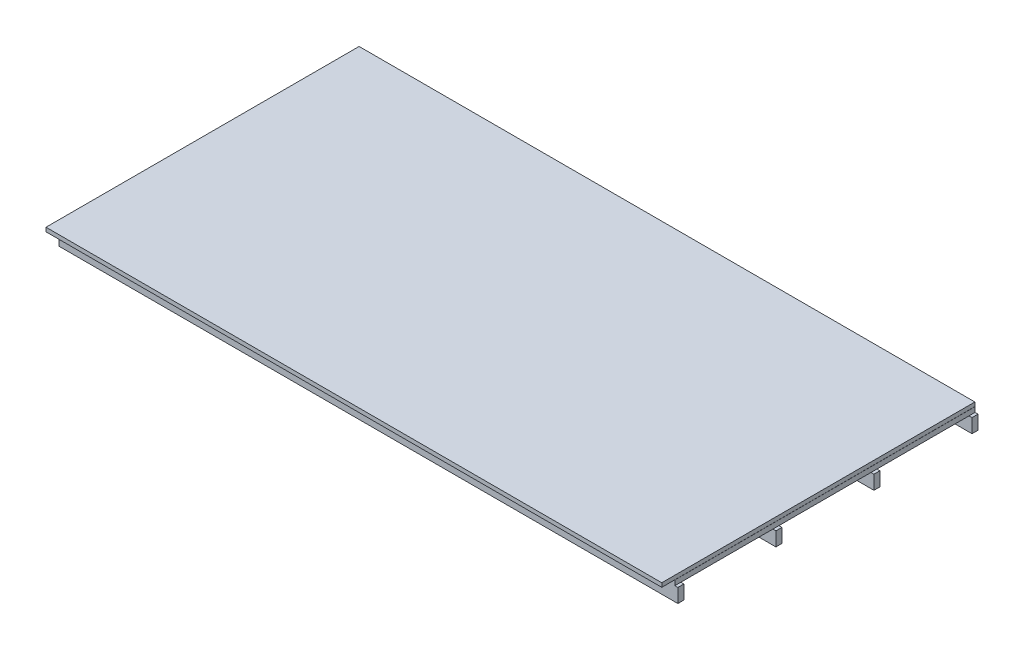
ISO-10303-21;
HEADER;
FILE_DESCRIPTION(('STEP AP214'),'2;1');
FILE_NAME('part.step','',(''),(''),'','','');
FILE_SCHEMA(('AUTOMOTIVE_DESIGN { 1 0 10303 214 1 1 1 1 }'));
ENDSEC;
DATA;
#1=APPLICATION_CONTEXT('core data for automotive mechanical design processes');
#2=APPLICATION_PROTOCOL_DEFINITION('international standard','automotive_design',2000,#1);
#3=PRODUCT_CONTEXT('',#1,'mechanical');
#4=PRODUCT('Part','Part','',(#3));
#5=PRODUCT_RELATED_PRODUCT_CATEGORY('part','',(#4));
#6=PRODUCT_DEFINITION_FORMATION('','',#4);
#7=PRODUCT_DEFINITION_CONTEXT('part definition',#1,'design');
#8=PRODUCT_DEFINITION('design','',#6,#7);
#9=PRODUCT_DEFINITION_SHAPE('','',#8);
#10=(LENGTH_UNIT() NAMED_UNIT(*) SI_UNIT(.MILLI.,.METRE.));
#11=(NAMED_UNIT(*) PLANE_ANGLE_UNIT() SI_UNIT($,.RADIAN.));
#12=(NAMED_UNIT(*) SI_UNIT($,.STERADIAN.) SOLID_ANGLE_UNIT());
#13=UNCERTAINTY_MEASURE_WITH_UNIT(LENGTH_MEASURE(1.E-05),#10,'distance_accuracy_value','');
#14=(GEOMETRIC_REPRESENTATION_CONTEXT(3) GLOBAL_UNCERTAINTY_ASSIGNED_CONTEXT((#13)) GLOBAL_UNIT_ASSIGNED_CONTEXT((#10,
#11,#12)) REPRESENTATION_CONTEXT('',''));
#15=CARTESIAN_POINT('',(0.,0.,0.));
#16=DIRECTION('',(0.,0.,1.));
#17=DIRECTION('',(1.,0.,0.));
#18=AXIS2_PLACEMENT_3D('',#15,#16,#17);
#19=CARTESIAN_POINT('',(3060.,95.,-751.665));
#20=DIRECTION('',(0.,1.,0.));
#21=DIRECTION('',(0.,0.,1.));
#22=AXIS2_PLACEMENT_3D('',#19,#20,#21);
#23=PLANE('',#22);
#24=DIRECTION('',(-1.,0.,0.));
#25=VECTOR('',#24,1.);
#26=CARTESIAN_POINT('',(3060.,95.,-751.665));
#27=LINE('',#26,#25);
#28=CARTESIAN_POINT('',(3085.,95.,-751.665));
#29=VERTEX_POINT('',#28);
#30=CARTESIAN_POINT('',(3084.36688987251,95.,-751.665));
#31=VERTEX_POINT('',#30);
#32=EDGE_CURVE('E54',#29,#31,#27,.T.);
#33=ORIENTED_EDGE('',*,*,#32,.T.);
#34=DIRECTION('',(0.,0.,1.));
#35=VECTOR('',#34,1.);
#36=CARTESIAN_POINT('',(3084.36688987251,95.,-751.665));
#37=LINE('',#36,#35);
#38=CARTESIAN_POINT('',(3084.36688987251,95.,751.665));
#39=VERTEX_POINT('',#38);
#40=EDGE_CURVE('E11',#31,#39,#37,.T.);
#41=ORIENTED_EDGE('',*,*,#40,.T.);
#42=DIRECTION('',(-1.,0.,0.));
#43=VECTOR('',#42,1.);
#44=CARTESIAN_POINT('',(3060.,95.,751.665));
#45=LINE('',#44,#43);
#46=CARTESIAN_POINT('',(3085.,95.,751.665));
#47=VERTEX_POINT('',#46);
#48=EDGE_CURVE('E596',#47,#39,#45,.T.);
#49=ORIENTED_EDGE('',*,*,#48,.F.);
#50=DIRECTION('',(0.,0.,1.));
#51=VECTOR('',#50,1.);
#52=CARTESIAN_POINT('',(3085.,95.,-751.665));
#53=LINE('',#52,#51);
#54=EDGE_CURVE('E609',#29,#47,#53,.T.);
#55=ORIENTED_EDGE('',*,*,#54,.F.);
#56=EDGE_LOOP('',(#33,#41,#49,#55));
#57=FACE_BOUND('',#56,.T.);
#58=ADVANCED_FACE('F40',(#57),#23,.T.);
#59=CARTESIAN_POINT('',(3100.,70.,751.665));
#60=DIRECTION('',(0.,-1.,0.));
#61=DIRECTION('',(0.,0.,-1.));
#62=AXIS2_PLACEMENT_3D('',#59,#60,#61);
#63=PLANE('',#62);
#64=DIRECTION('',(-1.,0.,0.));
#65=VECTOR('',#64,1.);
#66=CARTESIAN_POINT('',(3100.,70.,751.665));
#67=LINE('',#66,#65);
#68=CARTESIAN_POINT('',(3060.,70.,751.665));
#69=VERTEX_POINT('',#68);
#70=CARTESIAN_POINT('',(2575.,70.,751.665));
#71=VERTEX_POINT('',#70);
#72=EDGE_CURVE('E984',#69,#71,#67,.T.);
#73=ORIENTED_EDGE('',*,*,#72,.F.);
#74=DIRECTION('',(0.,0.,1.));
#75=VECTOR('',#74,1.);
#76=CARTESIAN_POINT('',(3060.,70.,-751.665));
#77=LINE('',#76,#75);
#78=CARTESIAN_POINT('',(3060.,70.,721.664999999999));
#79=VERTEX_POINT('',#78);
#80=EDGE_CURVE('E599',#79,#69,#77,.T.);
#81=ORIENTED_EDGE('',*,*,#80,.F.);
#82=DIRECTION('',(-1.,0.,0.));
#83=VECTOR('',#82,1.);
#84=CARTESIAN_POINT('',(3100.,70.,721.665));
#85=LINE('',#84,#83);
#86=CARTESIAN_POINT('',(2575.,70.,721.664999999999));
#87=VERTEX_POINT('',#86);
#88=EDGE_CURVE('E989',#79,#87,#85,.T.);
#89=ORIENTED_EDGE('',*,*,#88,.T.);
#90=DIRECTION('',(0.,0.,1.));
#91=VECTOR('',#90,1.);
#92=CARTESIAN_POINT('',(2575.,70.,-751.665));
#93=LINE('',#92,#91);
#94=EDGE_CURVE('E657',#87,#71,#93,.T.);
#95=ORIENTED_EDGE('',*,*,#94,.T.);
#96=EDGE_LOOP('',(#73,#81,#89,#95));
#97=FACE_BOUND('',#96,.T.);
#98=ADVANCED_FACE('F1278',(#97),#63,.F.);
#99=CARTESIAN_POINT('',(3100.,70.,260.555));
#100=DIRECTION('',(0.,-1.,0.));
#101=DIRECTION('',(0.,0.,-1.));
#102=AXIS2_PLACEMENT_3D('',#99,#100,#101);
#103=PLANE('',#102);
#104=DIRECTION('',(-1.,0.,0.));
#105=VECTOR('',#104,1.);
#106=CARTESIAN_POINT('',(3100.,70.,260.555));
#107=LINE('',#106,#105);
#108=CARTESIAN_POINT('',(3060.,70.,260.555));
#109=VERTEX_POINT('',#108);
#110=CARTESIAN_POINT('',(2575.,70.,260.555));
#111=VERTEX_POINT('',#110);
#112=EDGE_CURVE('E929',#109,#111,#107,.T.);
#113=ORIENTED_EDGE('',*,*,#112,.F.);
#114=CARTESIAN_POINT('',(3060.,70.,230.555));
#115=VERTEX_POINT('',#114);
#116=EDGE_CURVE('E1289',#115,#109,#77,.T.);
#117=ORIENTED_EDGE('',*,*,#116,.F.);
#118=DIRECTION('',(-1.,0.,0.));
#119=VECTOR('',#118,1.);
#120=CARTESIAN_POINT('',(3100.,70.,230.555));
#121=LINE('',#120,#119);
#122=CARTESIAN_POINT('',(2575.,70.,230.555));
#123=VERTEX_POINT('',#122);
#124=EDGE_CURVE('E934',#115,#123,#121,.T.);
#125=ORIENTED_EDGE('',*,*,#124,.T.);
#126=EDGE_CURVE('E1203',#123,#111,#93,.T.);
#127=ORIENTED_EDGE('',*,*,#126,.T.);
#128=EDGE_LOOP('',(#113,#117,#125,#127));
#129=FACE_BOUND('',#128,.T.);
#130=ADVANCED_FACE('F1285',(#129),#103,.F.);
#131=CARTESIAN_POINT('',(3100.,70.,-260.555));
#132=DIRECTION('',(0.,-1.,0.));
#133=DIRECTION('',(0.,0.,-1.));
#134=AXIS2_PLACEMENT_3D('',#131,#132,#133);
#135=PLANE('',#134);
#136=DIRECTION('',(-1.,0.,0.));
#137=VECTOR('',#136,1.);
#138=CARTESIAN_POINT('',(3100.,70.,-230.555));
#139=LINE('',#138,#137);
#140=CARTESIAN_POINT('',(3060.,70.,-230.555));
#141=VERTEX_POINT('',#140);
#142=CARTESIAN_POINT('',(2575.,70.,-230.555));
#143=VERTEX_POINT('',#142);
#144=EDGE_CURVE('E899',#141,#143,#139,.T.);
#145=ORIENTED_EDGE('',*,*,#144,.F.);
#146=CARTESIAN_POINT('',(3060.,70.,-260.555));
#147=VERTEX_POINT('',#146);
#148=EDGE_CURVE('E1206',#147,#141,#77,.T.);
#149=ORIENTED_EDGE('',*,*,#148,.F.);
#150=DIRECTION('',(-1.,0.,0.));
#151=VECTOR('',#150,1.);
#152=CARTESIAN_POINT('',(3100.,70.,-260.555));
#153=LINE('',#152,#151);
#154=CARTESIAN_POINT('',(2575.,70.,-260.555));
#155=VERTEX_POINT('',#154);
#156=EDGE_CURVE('E904',#147,#155,#153,.T.);
#157=ORIENTED_EDGE('',*,*,#156,.T.);
#158=EDGE_CURVE('E1129',#155,#143,#93,.T.);
#159=ORIENTED_EDGE('',*,*,#158,.T.);
#160=EDGE_LOOP('',(#145,#149,#157,#159));
#161=FACE_BOUND('',#160,.T.);
#162=ADVANCED_FACE('F1204',(#161),#135,.F.);
#163=CARTESIAN_POINT('',(3100.,70.,-751.665));
#164=DIRECTION('',(0.,-1.,0.));
#165=DIRECTION('',(0.,0.,-1.));
#166=AXIS2_PLACEMENT_3D('',#163,#164,#165);
#167=PLANE('',#166);
#168=DIRECTION('',(-1.,0.,0.));
#169=VECTOR('',#168,1.);
#170=CARTESIAN_POINT('',(3100.,70.,-721.665));
#171=LINE('',#170,#169);
#172=CARTESIAN_POINT('',(3060.,70.,-721.665));
#173=VERTEX_POINT('',#172);
#174=CARTESIAN_POINT('',(2575.,70.,-721.665));
#175=VERTEX_POINT('',#174);
#176=EDGE_CURVE('E866',#173,#175,#171,.T.);
#177=ORIENTED_EDGE('',*,*,#176,.F.);
#178=CARTESIAN_POINT('',(3060.,70.,-751.665));
#179=VERTEX_POINT('',#178);
#180=EDGE_CURVE('E616',#179,#173,#77,.T.);
#181=ORIENTED_EDGE('',*,*,#180,.F.);
#182=DIRECTION('',(-1.,0.,0.));
#183=VECTOR('',#182,1.);
#184=CARTESIAN_POINT('',(3100.,70.,-751.665));
#185=LINE('',#184,#183);
#186=CARTESIAN_POINT('',(2575.,70.,-751.665));
#187=VERTEX_POINT('',#186);
#188=EDGE_CURVE('E871',#179,#187,#185,.T.);
#189=ORIENTED_EDGE('',*,*,#188,.T.);
#190=EDGE_CURVE('E653',#187,#175,#93,.T.);
#191=ORIENTED_EDGE('',*,*,#190,.T.);
#192=EDGE_LOOP('',(#177,#181,#189,#191));
#193=FACE_BOUND('',#192,.T.);
#194=ADVANCED_FACE('F1130',(#193),#167,.F.);
#195=CARTESIAN_POINT('',(2550.,70.,751.665));
#196=VERTEX_POINT('',#195);
#197=CARTESIAN_POINT('',(2065.,70.,751.665));
#198=VERTEX_POINT('',#197);
#199=EDGE_CURVE('E1265',#196,#198,#67,.T.);
#200=ORIENTED_EDGE('',*,*,#199,.F.);
#201=DIRECTION('',(0.,0.,1.));
#202=VECTOR('',#201,1.);
#203=CARTESIAN_POINT('',(2550.,70.,-751.665));
#204=LINE('',#203,#202);
#205=CARTESIAN_POINT('',(2550.,70.,721.664999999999));
#206=VERTEX_POINT('',#205);
#207=EDGE_CURVE('E640',#206,#196,#204,.T.);
#208=ORIENTED_EDGE('',*,*,#207,.F.);
#209=CARTESIAN_POINT('',(2065.,70.,721.664999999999));
#210=VERTEX_POINT('',#209);
#211=EDGE_CURVE('E1462',#206,#210,#85,.T.);
#212=ORIENTED_EDGE('',*,*,#211,.T.);
#213=DIRECTION('',(0.,0.,1.));
#214=VECTOR('',#213,1.);
#215=CARTESIAN_POINT('',(2065.,70.,-751.665));
#216=LINE('',#215,#214);
#217=EDGE_CURVE('E699',#210,#198,#216,.T.);
#218=ORIENTED_EDGE('',*,*,#217,.T.);
#219=EDGE_LOOP('',(#200,#208,#212,#218));
#220=FACE_BOUND('',#219,.T.);
#221=ADVANCED_FACE('F1459',(#220),#63,.F.);
#222=CARTESIAN_POINT('',(2550.,70.,260.555));
#223=VERTEX_POINT('',#222);
#224=CARTESIAN_POINT('',(2065.,70.,260.555));
#225=VERTEX_POINT('',#224);
#226=EDGE_CURVE('E1440',#223,#225,#107,.T.);
#227=ORIENTED_EDGE('',*,*,#226,.F.);
#228=CARTESIAN_POINT('',(2550.,70.,230.555));
#229=VERTEX_POINT('',#228);
#230=EDGE_CURVE('E2328',#229,#223,#204,.T.);
#231=ORIENTED_EDGE('',*,*,#230,.F.);
#232=CARTESIAN_POINT('',(2065.,70.,230.555));
#233=VERTEX_POINT('',#232);
#234=EDGE_CURVE('E1290',#229,#233,#121,.T.);
#235=ORIENTED_EDGE('',*,*,#234,.T.);
#236=EDGE_CURVE('E1449',#233,#225,#216,.T.);
#237=ORIENTED_EDGE('',*,*,#236,.T.);
#238=EDGE_LOOP('',(#227,#231,#235,#237));
#239=FACE_BOUND('',#238,.T.);
#240=ADVANCED_FACE('F1450',(#239),#103,.F.);
#241=CARTESIAN_POINT('',(2550.,70.,-230.555));
#242=VERTEX_POINT('',#241);
#243=CARTESIAN_POINT('',(2065.,70.,-230.555));
#244=VERTEX_POINT('',#243);
#245=EDGE_CURVE('E1184',#242,#244,#139,.T.);
#246=ORIENTED_EDGE('',*,*,#245,.F.);
#247=CARTESIAN_POINT('',(2550.,70.,-260.555));
#248=VERTEX_POINT('',#247);
#249=EDGE_CURVE('E2329',#248,#242,#204,.T.);
#250=ORIENTED_EDGE('',*,*,#249,.F.);
#251=CARTESIAN_POINT('',(2065.,70.,-260.555));
#252=VERTEX_POINT('',#251);
#253=EDGE_CURVE('E1207',#248,#252,#153,.T.);
#254=ORIENTED_EDGE('',*,*,#253,.T.);
#255=EDGE_CURVE('E1455',#252,#244,#216,.T.);
#256=ORIENTED_EDGE('',*,*,#255,.T.);
#257=EDGE_LOOP('',(#246,#250,#254,#256));
#258=FACE_BOUND('',#257,.T.);
#259=ADVANCED_FACE('F1483',(#258),#135,.F.);
#260=CARTESIAN_POINT('',(2550.,70.,-721.665));
#261=VERTEX_POINT('',#260);
#262=CARTESIAN_POINT('',(2065.,70.,-721.665));
#263=VERTEX_POINT('',#262);
#264=EDGE_CURVE('E1106',#261,#263,#171,.T.);
#265=ORIENTED_EDGE('',*,*,#264,.F.);
#266=CARTESIAN_POINT('',(2550.,70.,-751.665));
#267=VERTEX_POINT('',#266);
#268=EDGE_CURVE('E658',#267,#261,#204,.T.);
#269=ORIENTED_EDGE('',*,*,#268,.F.);
#270=CARTESIAN_POINT('',(2065.,70.,-751.665));
#271=VERTEX_POINT('',#270);
#272=EDGE_CURVE('E1133',#267,#271,#185,.T.);
#273=ORIENTED_EDGE('',*,*,#272,.T.);
#274=EDGE_CURVE('E695',#271,#263,#216,.T.);
#275=ORIENTED_EDGE('',*,*,#274,.T.);
#276=EDGE_LOOP('',(#265,#269,#273,#275));
#277=FACE_BOUND('',#276,.T.);
#278=ADVANCED_FACE('F1474',(#277),#167,.F.);
#279=CARTESIAN_POINT('',(2040.,70.,751.665));
#280=VERTEX_POINT('',#279);
#281=CARTESIAN_POINT('',(1555.,70.,751.665));
#282=VERTEX_POINT('',#281);
#283=EDGE_CURVE('E1262',#280,#282,#67,.T.);
#284=ORIENTED_EDGE('',*,*,#283,.F.);
#285=DIRECTION('',(0.,0.,1.));
#286=VECTOR('',#285,1.);
#287=CARTESIAN_POINT('',(2040.,70.,-751.665));
#288=LINE('',#287,#286);
#289=CARTESIAN_POINT('',(2040.,70.,721.664999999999));
#290=VERTEX_POINT('',#289);
#291=EDGE_CURVE('E682',#290,#280,#288,.T.);
#292=ORIENTED_EDGE('',*,*,#291,.F.);
#293=CARTESIAN_POINT('',(1555.,70.,721.664999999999));
#294=VERTEX_POINT('',#293);
#295=EDGE_CURVE('E1433',#290,#294,#85,.T.);
#296=ORIENTED_EDGE('',*,*,#295,.T.);
#297=DIRECTION('',(0.,0.,1.));
#298=VECTOR('',#297,1.);
#299=CARTESIAN_POINT('',(1555.,70.,-751.665));
#300=LINE('',#299,#298);
#301=EDGE_CURVE('E741',#294,#282,#300,.T.);
#302=ORIENTED_EDGE('',*,*,#301,.T.);
#303=EDGE_LOOP('',(#284,#292,#296,#302));
#304=FACE_BOUND('',#303,.T.);
#305=ADVANCED_FACE('F1431',(#304),#63,.F.);
#306=CARTESIAN_POINT('',(2040.,70.,260.555));
#307=VERTEX_POINT('',#306);
#308=CARTESIAN_POINT('',(1555.,70.,260.555));
#309=VERTEX_POINT('',#308);
#310=EDGE_CURVE('E1439',#307,#309,#107,.T.);
#311=ORIENTED_EDGE('',*,*,#310,.F.);
#312=CARTESIAN_POINT('',(2040.,70.,230.555));
#313=VERTEX_POINT('',#312);
#314=EDGE_CURVE('E1420',#313,#307,#288,.T.);
#315=ORIENTED_EDGE('',*,*,#314,.F.);
#316=CARTESIAN_POINT('',(1555.,70.,230.555));
#317=VERTEX_POINT('',#316);
#318=EDGE_CURVE('E1291',#313,#317,#121,.T.);
#319=ORIENTED_EDGE('',*,*,#318,.T.);
#320=EDGE_CURVE('E1402',#317,#309,#300,.T.);
#321=ORIENTED_EDGE('',*,*,#320,.T.);
#322=EDGE_LOOP('',(#311,#315,#319,#321));
#323=FACE_BOUND('',#322,.T.);
#324=ADVANCED_FACE('F1438',(#323),#103,.F.);
#325=CARTESIAN_POINT('',(2040.,70.,-230.555));
#326=VERTEX_POINT('',#325);
#327=CARTESIAN_POINT('',(1555.,70.,-230.555));
#328=VERTEX_POINT('',#327);
#329=EDGE_CURVE('E1181',#326,#328,#139,.T.);
#330=ORIENTED_EDGE('',*,*,#329,.F.);
#331=CARTESIAN_POINT('',(2040.,70.,-260.555));
#332=VERTEX_POINT('',#331);
#333=EDGE_CURVE('E1417',#332,#326,#288,.T.);
#334=ORIENTED_EDGE('',*,*,#333,.F.);
#335=CARTESIAN_POINT('',(1555.,70.,-260.555));
#336=VERTEX_POINT('',#335);
#337=EDGE_CURVE('E1208',#332,#336,#153,.T.);
#338=ORIENTED_EDGE('',*,*,#337,.T.);
#339=EDGE_CURVE('E1399',#336,#328,#300,.T.);
#340=ORIENTED_EDGE('',*,*,#339,.T.);
#341=EDGE_LOOP('',(#330,#334,#338,#340));
#342=FACE_BOUND('',#341,.T.);
#343=ADVANCED_FACE('F1403',(#342),#135,.F.);
#344=CARTESIAN_POINT('',(2040.,70.,-721.665));
#345=VERTEX_POINT('',#344);
#346=CARTESIAN_POINT('',(1555.,70.,-721.665));
#347=VERTEX_POINT('',#346);
#348=EDGE_CURVE('E1099',#345,#347,#171,.T.);
#349=ORIENTED_EDGE('',*,*,#348,.F.);
#350=CARTESIAN_POINT('',(2040.,70.,-751.665));
#351=VERTEX_POINT('',#350);
#352=EDGE_CURVE('E700',#351,#345,#288,.T.);
#353=ORIENTED_EDGE('',*,*,#352,.F.);
#354=CARTESIAN_POINT('',(1555.,70.,-751.665));
#355=VERTEX_POINT('',#354);
#356=EDGE_CURVE('E1134',#351,#355,#185,.T.);
#357=ORIENTED_EDGE('',*,*,#356,.T.);
#358=EDGE_CURVE('E737',#355,#347,#300,.T.);
#359=ORIENTED_EDGE('',*,*,#358,.T.);
#360=EDGE_LOOP('',(#349,#353,#357,#359));
#361=FACE_BOUND('',#360,.T.);
#362=ADVANCED_FACE('F1470',(#361),#167,.F.);
#363=CARTESIAN_POINT('',(1530.,70.,751.665));
#364=VERTEX_POINT('',#363);
#365=CARTESIAN_POINT('',(1045.,70.,751.665));
#366=VERTEX_POINT('',#365);
#367=EDGE_CURVE('E1259',#364,#366,#67,.T.);
#368=ORIENTED_EDGE('',*,*,#367,.F.);
#369=DIRECTION('',(0.,0.,1.));
#370=VECTOR('',#369,1.);
#371=CARTESIAN_POINT('',(1530.,70.,-751.665));
#372=LINE('',#371,#370);
#373=CARTESIAN_POINT('',(1530.,70.,721.664999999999));
#374=VERTEX_POINT('',#373);
#375=EDGE_CURVE('E724',#374,#364,#372,.T.);
#376=ORIENTED_EDGE('',*,*,#375,.F.);
#377=CARTESIAN_POINT('',(1045.,70.,721.664999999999));
#378=VERTEX_POINT('',#377);
#379=EDGE_CURVE('E2303',#374,#378,#85,.T.);
#380=ORIENTED_EDGE('',*,*,#379,.T.);
#381=DIRECTION('',(0.,0.,1.));
#382=VECTOR('',#381,1.);
#383=CARTESIAN_POINT('',(1045.,70.,-751.665));
#384=LINE('',#383,#382);
#385=EDGE_CURVE('E783',#378,#366,#384,.T.);
#386=ORIENTED_EDGE('',*,*,#385,.T.);
#387=EDGE_LOOP('',(#368,#376,#380,#386));
#388=FACE_BOUND('',#387,.T.);
#389=ADVANCED_FACE('F1472',(#388),#63,.F.);
#390=CARTESIAN_POINT('',(1530.,70.,260.555));
#391=VERTEX_POINT('',#390);
#392=CARTESIAN_POINT('',(1045.,70.,260.555));
#393=VERTEX_POINT('',#392);
#394=EDGE_CURVE('E1441',#391,#393,#107,.T.);
#395=ORIENTED_EDGE('',*,*,#394,.F.);
#396=CARTESIAN_POINT('',(1530.,70.,230.555));
#397=VERTEX_POINT('',#396);
#398=EDGE_CURVE('E2313',#397,#391,#372,.T.);
#399=ORIENTED_EDGE('',*,*,#398,.F.);
#400=CARTESIAN_POINT('',(1045.,70.,230.555));
#401=VERTEX_POINT('',#400);
#402=EDGE_CURVE('E1297',#397,#401,#121,.T.);
#403=ORIENTED_EDGE('',*,*,#402,.T.);
#404=EDGE_CURVE('E1385',#401,#393,#384,.T.);
#405=ORIENTED_EDGE('',*,*,#404,.T.);
#406=EDGE_LOOP('',(#395,#399,#403,#405));
#407=FACE_BOUND('',#406,.T.);
#408=ADVANCED_FACE('F1479',(#407),#103,.F.);
#409=CARTESIAN_POINT('',(1530.,70.,-230.555));
#410=VERTEX_POINT('',#409);
#411=CARTESIAN_POINT('',(1045.,70.,-230.555));
#412=VERTEX_POINT('',#411);
#413=EDGE_CURVE('E1178',#410,#412,#139,.T.);
#414=ORIENTED_EDGE('',*,*,#413,.F.);
#415=CARTESIAN_POINT('',(1530.,70.,-260.555));
#416=VERTEX_POINT('',#415);
#417=EDGE_CURVE('E1387',#416,#410,#372,.T.);
#418=ORIENTED_EDGE('',*,*,#417,.F.);
#419=CARTESIAN_POINT('',(1045.,70.,-260.555));
#420=VERTEX_POINT('',#419);
#421=EDGE_CURVE('E1214',#416,#420,#153,.T.);
#422=ORIENTED_EDGE('',*,*,#421,.T.);
#423=EDGE_CURVE('E1357',#420,#412,#384,.T.);
#424=ORIENTED_EDGE('',*,*,#423,.T.);
#425=EDGE_LOOP('',(#414,#418,#422,#424));
#426=FACE_BOUND('',#425,.T.);
#427=ADVANCED_FACE('F1386',(#426),#135,.F.);
#428=CARTESIAN_POINT('',(1530.,70.,-721.665));
#429=VERTEX_POINT('',#428);
#430=CARTESIAN_POINT('',(1045.,70.,-721.665));
#431=VERTEX_POINT('',#430);
#432=EDGE_CURVE('E1097',#429,#431,#171,.T.);
#433=ORIENTED_EDGE('',*,*,#432,.F.);
#434=CARTESIAN_POINT('',(1530.,70.,-751.665));
#435=VERTEX_POINT('',#434);
#436=EDGE_CURVE('E742',#435,#429,#372,.T.);
#437=ORIENTED_EDGE('',*,*,#436,.F.);
#438=CARTESIAN_POINT('',(1045.,70.,-751.665));
#439=VERTEX_POINT('',#438);
#440=EDGE_CURVE('E1139',#435,#439,#185,.T.);
#441=ORIENTED_EDGE('',*,*,#440,.T.);
#442=EDGE_CURVE('E779',#439,#431,#384,.T.);
#443=ORIENTED_EDGE('',*,*,#442,.T.);
#444=EDGE_LOOP('',(#433,#437,#441,#443));
#445=FACE_BOUND('',#444,.T.);
#446=ADVANCED_FACE('F1358',(#445),#167,.F.);
#447=CARTESIAN_POINT('',(1020.,70.,751.665));
#448=VERTEX_POINT('',#447);
#449=CARTESIAN_POINT('',(535.,70.,751.665));
#450=VERTEX_POINT('',#449);
#451=EDGE_CURVE('E1258',#448,#450,#67,.T.);
#452=ORIENTED_EDGE('',*,*,#451,.F.);
#453=DIRECTION('',(0.,0.,1.));
#454=VECTOR('',#453,1.);
#455=CARTESIAN_POINT('',(1020.,70.,-751.665));
#456=LINE('',#455,#454);
#457=CARTESIAN_POINT('',(1020.,70.,721.664999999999));
#458=VERTEX_POINT('',#457);
#459=EDGE_CURVE('E766',#458,#448,#456,.T.);
#460=ORIENTED_EDGE('',*,*,#459,.F.);
#461=CARTESIAN_POINT('',(535.,70.,721.664999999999));
#462=VERTEX_POINT('',#461);
#463=EDGE_CURVE('E1338',#458,#462,#85,.T.);
#464=ORIENTED_EDGE('',*,*,#463,.T.);
#465=DIRECTION('',(0.,0.,1.));
#466=VECTOR('',#465,1.);
#467=CARTESIAN_POINT('',(535.,70.,-751.665));
#468=LINE('',#467,#466);
#469=EDGE_CURVE('E825',#462,#450,#468,.T.);
#470=ORIENTED_EDGE('',*,*,#469,.T.);
#471=EDGE_LOOP('',(#452,#460,#464,#470));
#472=FACE_BOUND('',#471,.T.);
#473=ADVANCED_FACE('F1335',(#472),#63,.F.);
#474=CARTESIAN_POINT('',(1020.,70.,260.555));
#475=VERTEX_POINT('',#474);
#476=CARTESIAN_POINT('',(535.,70.,260.555));
#477=VERTEX_POINT('',#476);
#478=EDGE_CURVE('E1316',#475,#477,#107,.T.);
#479=ORIENTED_EDGE('',*,*,#478,.F.);
#480=CARTESIAN_POINT('',(1020.,70.,230.555));
#481=VERTEX_POINT('',#480);
#482=EDGE_CURVE('E1374',#481,#475,#456,.T.);
#483=ORIENTED_EDGE('',*,*,#482,.F.);
#484=CARTESIAN_POINT('',(535.,70.,230.555));
#485=VERTEX_POINT('',#484);
#486=EDGE_CURVE('E1303',#481,#485,#121,.T.);
#487=ORIENTED_EDGE('',*,*,#486,.T.);
#488=EDGE_CURVE('E1325',#485,#477,#468,.T.);
#489=ORIENTED_EDGE('',*,*,#488,.T.);
#490=EDGE_LOOP('',(#479,#483,#487,#489));
#491=FACE_BOUND('',#490,.T.);
#492=ADVANCED_FACE('F1326',(#491),#103,.F.);
#493=CARTESIAN_POINT('',(1020.,70.,-230.555));
#494=VERTEX_POINT('',#493);
#495=CARTESIAN_POINT('',(535.,70.,-230.555));
#496=VERTEX_POINT('',#495);
#497=EDGE_CURVE('E1177',#494,#496,#139,.T.);
#498=ORIENTED_EDGE('',*,*,#497,.F.);
#499=CARTESIAN_POINT('',(1020.,70.,-260.555));
#500=VERTEX_POINT('',#499);
#501=EDGE_CURVE('E1377',#500,#494,#456,.T.);
#502=ORIENTED_EDGE('',*,*,#501,.F.);
#503=CARTESIAN_POINT('',(535.,70.,-260.555));
#504=VERTEX_POINT('',#503);
#505=EDGE_CURVE('E1220',#500,#504,#153,.T.);
#506=ORIENTED_EDGE('',*,*,#505,.T.);
#507=EDGE_CURVE('E1331',#504,#496,#468,.T.);
#508=ORIENTED_EDGE('',*,*,#507,.T.);
#509=EDGE_LOOP('',(#498,#502,#506,#508));
#510=FACE_BOUND('',#509,.T.);
#511=ADVANCED_FACE('F1379',(#510),#135,.F.);
#512=CARTESIAN_POINT('',(1020.,70.,-721.665));
#513=VERTEX_POINT('',#512);
#514=CARTESIAN_POINT('',(535.,70.,-721.665));
#515=VERTEX_POINT('',#514);
#516=EDGE_CURVE('E1092',#513,#515,#171,.T.);
#517=ORIENTED_EDGE('',*,*,#516,.F.);
#518=CARTESIAN_POINT('',(1020.,70.,-751.665));
#519=VERTEX_POINT('',#518);
#520=EDGE_CURVE('E784',#519,#513,#456,.T.);
#521=ORIENTED_EDGE('',*,*,#520,.F.);
#522=CARTESIAN_POINT('',(535.,70.,-751.665));
#523=VERTEX_POINT('',#522);
#524=EDGE_CURVE('E1144',#519,#523,#185,.T.);
#525=ORIENTED_EDGE('',*,*,#524,.T.);
#526=EDGE_CURVE('E821',#523,#515,#468,.T.);
#527=ORIENTED_EDGE('',*,*,#526,.T.);
#528=EDGE_LOOP('',(#517,#521,#525,#527));
#529=FACE_BOUND('',#528,.T.);
#530=ADVANCED_FACE('F1346',(#529),#167,.F.);
#531=CARTESIAN_POINT('',(510.,70.,751.665));
#532=VERTEX_POINT('',#531);
#533=CARTESIAN_POINT('',(24.9999999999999,70.,751.665));
#534=VERTEX_POINT('',#533);
#535=EDGE_CURVE('E973',#532,#534,#67,.T.);
#536=ORIENTED_EDGE('',*,*,#535,.F.);
#537=DIRECTION('',(0.,0.,1.));
#538=VECTOR('',#537,1.);
#539=CARTESIAN_POINT('',(510.,70.,-751.665));
#540=LINE('',#539,#538);
#541=CARTESIAN_POINT('',(510.,70.,721.664999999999));
#542=VERTEX_POINT('',#541);
#543=EDGE_CURVE('E808',#542,#532,#540,.T.);
#544=ORIENTED_EDGE('',*,*,#543,.F.);
#545=CARTESIAN_POINT('',(25.,70.,721.664999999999));
#546=VERTEX_POINT('',#545);
#547=EDGE_CURVE('E1040',#542,#546,#85,.T.);
#548=ORIENTED_EDGE('',*,*,#547,.T.);
#549=DIRECTION('',(0.,0.,1.));
#550=VECTOR('',#549,1.);
#551=CARTESIAN_POINT('',(25.,70.,-751.665));
#552=LINE('',#551,#550);
#553=EDGE_CURVE('E958',#546,#534,#552,.T.);
#554=ORIENTED_EDGE('',*,*,#553,.T.);
#555=EDGE_LOOP('',(#536,#544,#548,#554));
#556=FACE_BOUND('',#555,.T.);
#557=ADVANCED_FACE('F1257',(#556),#63,.F.);
#558=CARTESIAN_POINT('',(510.,70.,260.555));
#559=VERTEX_POINT('',#558);
#560=CARTESIAN_POINT('',(24.9999999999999,70.,260.555));
#561=VERTEX_POINT('',#560);
#562=EDGE_CURVE('E918',#559,#561,#107,.T.);
#563=ORIENTED_EDGE('',*,*,#562,.F.);
#564=CARTESIAN_POINT('',(510.,70.,230.555));
#565=VERTEX_POINT('',#564);
#566=EDGE_CURVE('E1246',#565,#559,#540,.T.);
#567=ORIENTED_EDGE('',*,*,#566,.F.);
#568=CARTESIAN_POINT('',(24.9999999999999,70.,230.555));
#569=VERTEX_POINT('',#568);
#570=EDGE_CURVE('E928',#565,#569,#121,.T.);
#571=ORIENTED_EDGE('',*,*,#570,.T.);
#572=EDGE_CURVE('E1013',#569,#561,#552,.T.);
#573=ORIENTED_EDGE('',*,*,#572,.T.);
#574=EDGE_LOOP('',(#563,#567,#571,#573));
#575=FACE_BOUND('',#574,.T.);
#576=ADVANCED_FACE('F1315',(#575),#103,.F.);
#577=CARTESIAN_POINT('',(510.,70.,-230.555));
#578=VERTEX_POINT('',#577);
#579=CARTESIAN_POINT('',(24.9999999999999,70.,-230.555));
#580=VERTEX_POINT('',#579);
#581=EDGE_CURVE('E1176',#578,#580,#139,.T.);
#582=ORIENTED_EDGE('',*,*,#581,.F.);
#583=CARTESIAN_POINT('',(510.,70.,-260.555));
#584=VERTEX_POINT('',#583);
#585=EDGE_CURVE('E1233',#584,#578,#540,.T.);
#586=ORIENTED_EDGE('',*,*,#585,.F.);
#587=CARTESIAN_POINT('',(25.,70.,-260.555));
#588=VERTEX_POINT('',#587);
#589=EDGE_CURVE('E1166',#584,#588,#153,.T.);
#590=ORIENTED_EDGE('',*,*,#589,.T.);
#591=EDGE_CURVE('E1016',#588,#580,#552,.T.);
#592=ORIENTED_EDGE('',*,*,#591,.T.);
#593=EDGE_LOOP('',(#582,#586,#590,#592));
#594=FACE_BOUND('',#593,.T.);
#595=ADVANCED_FACE('F1232',(#594),#135,.F.);
#596=CARTESIAN_POINT('',(510.,70.,-721.665));
#597=VERTEX_POINT('',#596);
#598=CARTESIAN_POINT('',(25.,70.,-721.665));
#599=VERTEX_POINT('',#598);
#600=EDGE_CURVE('E1087',#597,#599,#171,.T.);
#601=ORIENTED_EDGE('',*,*,#600,.F.);
#602=CARTESIAN_POINT('',(510.,70.,-751.665));
#603=VERTEX_POINT('',#602);
#604=EDGE_CURVE('E826',#603,#597,#540,.T.);
#605=ORIENTED_EDGE('',*,*,#604,.F.);
#606=CARTESIAN_POINT('',(24.9999999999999,70.,-751.665));
#607=VERTEX_POINT('',#606);
#608=EDGE_CURVE('E864',#603,#607,#185,.T.);
#609=ORIENTED_EDGE('',*,*,#608,.T.);
#610=EDGE_CURVE('E954',#607,#599,#552,.T.);
#611=ORIENTED_EDGE('',*,*,#610,.T.);
#612=EDGE_LOOP('',(#601,#605,#609,#611));
#613=FACE_BOUND('',#612,.T.);
#614=ADVANCED_FACE('F1157',(#613),#167,.F.);
#615=CARTESIAN_POINT('',(0.,70.,-751.665));
#616=DIRECTION('',(0.,-1.,0.));
#617=DIRECTION('',(0.,0.,-1.));
#618=AXIS2_PLACEMENT_3D('',#615,#616,#617);
#619=PLANE('',#618);
#620=DIRECTION('',(0.,0.,1.));
#621=VECTOR('',#620,1.);
#622=CARTESIAN_POINT('',(0.,70.,-751.665));
#623=LINE('',#622,#621);
#624=CARTESIAN_POINT('',(0.,70.,-721.665));
#625=VERTEX_POINT('',#624);
#626=CARTESIAN_POINT('',(0.,70.,-260.555));
#627=VERTEX_POINT('',#626);
#628=EDGE_CURVE('E959',#625,#627,#623,.T.);
#629=ORIENTED_EDGE('',*,*,#628,.F.);
#630=EDGE_CURVE('E860',#599,#625,#171,.T.);
#631=ORIENTED_EDGE('',*,*,#630,.F.);
#632=EDGE_CURVE('E957',#599,#588,#552,.T.);
#633=ORIENTED_EDGE('',*,*,#632,.T.);
#634=EDGE_CURVE('E898',#588,#627,#153,.T.);
#635=ORIENTED_EDGE('',*,*,#634,.T.);
#636=EDGE_LOOP('',(#629,#631,#633,#635));
#637=FACE_BOUND('',#636,.T.);
#638=ADVANCED_FACE('F1163',(#637),#619,.T.);
#639=CARTESIAN_POINT('',(0.,70.,-230.555));
#640=VERTEX_POINT('',#639);
#641=CARTESIAN_POINT('',(0.,70.,230.555));
#642=VERTEX_POINT('',#641);
#643=EDGE_CURVE('E962',#640,#642,#623,.T.);
#644=ORIENTED_EDGE('',*,*,#643,.F.);
#645=EDGE_CURVE('E894',#580,#640,#139,.T.);
#646=ORIENTED_EDGE('',*,*,#645,.F.);
#647=EDGE_CURVE('E1017',#580,#569,#552,.T.);
#648=ORIENTED_EDGE('',*,*,#647,.T.);
#649=DIRECTION('',(-1.,0.,0.));
#650=VECTOR('',#649,1.);
#651=CARTESIAN_POINT('',(0.,70.,230.555));
#652=LINE('',#651,#650);
#653=EDGE_CURVE('E995',#569,#642,#652,.T.);
#654=ORIENTED_EDGE('',*,*,#653,.T.);
#655=EDGE_LOOP('',(#644,#646,#648,#654));
#656=FACE_BOUND('',#655,.T.);
#657=ADVANCED_FACE('F1027',(#656),#619,.T.);
#658=CARTESIAN_POINT('',(0.,70.,260.555));
#659=VERTEX_POINT('',#658);
#660=CARTESIAN_POINT('',(0.,70.,721.664999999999));
#661=VERTEX_POINT('',#660);
#662=EDGE_CURVE('E946',#659,#661,#623,.T.);
#663=ORIENTED_EDGE('',*,*,#662,.F.);
#664=DIRECTION('',(1.,0.,0.));
#665=VECTOR('',#664,1.);
#666=CARTESIAN_POINT('',(0.,70.,260.555));
#667=LINE('',#666,#665);
#668=EDGE_CURVE('E48',#659,#561,#667,.T.);
#669=ORIENTED_EDGE('',*,*,#668,.T.);
#670=EDGE_CURVE('E961',#561,#546,#552,.T.);
#671=ORIENTED_EDGE('',*,*,#670,.T.);
#672=EDGE_CURVE('E983',#546,#661,#85,.T.);
#673=ORIENTED_EDGE('',*,*,#672,.T.);
#674=EDGE_LOOP('',(#663,#669,#671,#673));
#675=FACE_BOUND('',#674,.T.);
#676=ADVANCED_FACE('F1003',(#675),#619,.T.);
#677=CARTESIAN_POINT('',(3100.,0.,751.665));
#678=DIRECTION('',(0.,0.,-1.));
#679=DIRECTION('',(-1.,0.,0.));
#680=AXIS2_PLACEMENT_3D('',#677,#678,#679);
#681=PLANE('',#680);
#682=DIRECTION('',(0.,-1.,0.));
#683=VECTOR('',#682,1.);
#684=CARTESIAN_POINT('',(0.,0.,751.665));
#685=LINE('',#684,#683);
#686=CARTESIAN_POINT('',(0.,95.,751.665));
#687=VERTEX_POINT('',#686);
#688=CARTESIAN_POINT('',(0.,0.,751.665));
#689=VERTEX_POINT('',#688);
#690=EDGE_CURVE('E953',#687,#689,#685,.T.);
#691=ORIENTED_EDGE('',*,*,#690,.T.);
#692=DIRECTION('',(-1.,0.,0.));
#693=VECTOR('',#692,1.);
#694=CARTESIAN_POINT('',(3100.,0.,751.665));
#695=LINE('',#694,#693);
#696=CARTESIAN_POINT('',(3100.,0.,751.665));
#697=VERTEX_POINT('',#696);
#698=EDGE_CURVE('E992',#697,#689,#695,.T.);
#699=ORIENTED_EDGE('',*,*,#698,.F.);
#700=DIRECTION('',(0.,-1.,0.));
#701=VECTOR('',#700,1.);
#702=CARTESIAN_POINT('',(3100.,0.,751.665));
#703=LINE('',#702,#701);
#704=CARTESIAN_POINT('',(3100.,70.,751.665));
#705=VERTEX_POINT('',#704);
#706=EDGE_CURVE('E963',#705,#697,#703,.T.);
#707=ORIENTED_EDGE('',*,*,#706,.F.);
#708=CARTESIAN_POINT('',(3085.,70.,751.665));
#709=VERTEX_POINT('',#708);
#710=EDGE_CURVE('E980',#705,#709,#67,.T.);
#711=ORIENTED_EDGE('',*,*,#710,.T.);
#712=DIRECTION('',(0.,1.,0.));
#713=VECTOR('',#712,1.);
#714=CARTESIAN_POINT('',(3085.,70.,751.665));
#715=LINE('',#714,#713);
#716=EDGE_CURVE('E587',#709,#47,#715,.T.);
#717=ORIENTED_EDGE('',*,*,#716,.T.);
#718=ORIENTED_EDGE('',*,*,#48,.T.);
#719=CARTESIAN_POINT('',(3060.,95.,751.665));
#720=VERTEX_POINT('',#719);
#721=EDGE_CURVE('E603',#39,#720,#45,.T.);
#722=ORIENTED_EDGE('',*,*,#721,.T.);
#723=DIRECTION('',(0.,-1.,0.));
#724=VECTOR('',#723,1.);
#725=CARTESIAN_POINT('',(3060.,70.,751.665));
#726=LINE('',#725,#724);
#727=EDGE_CURVE('E585',#720,#69,#726,.T.);
#728=ORIENTED_EDGE('',*,*,#727,.T.);
#729=ORIENTED_EDGE('',*,*,#72,.T.);
#730=DIRECTION('',(0.,1.,0.));
#731=VECTOR('',#730,1.);
#732=CARTESIAN_POINT('',(2575.,70.,751.665));
#733=LINE('',#732,#731);
#734=CARTESIAN_POINT('',(2575.,95.,751.665));
#735=VERTEX_POINT('',#734);
#736=EDGE_CURVE('E642',#71,#735,#733,.T.);
#737=ORIENTED_EDGE('',*,*,#736,.T.);
#738=DIRECTION('',(-1.,0.,0.));
#739=VECTOR('',#738,1.);
#740=CARTESIAN_POINT('',(2550.,95.,751.665));
#741=LINE('',#740,#739);
#742=CARTESIAN_POINT('',(2550.,95.,751.665));
#743=VERTEX_POINT('',#742);
#744=EDGE_CURVE('E637',#735,#743,#741,.T.);
#745=ORIENTED_EDGE('',*,*,#744,.T.);
#746=DIRECTION('',(0.,-1.,0.));
#747=VECTOR('',#746,1.);
#748=CARTESIAN_POINT('',(2550.,70.,751.665));
#749=LINE('',#748,#747);
#750=EDGE_CURVE('E633',#743,#196,#749,.T.);
#751=ORIENTED_EDGE('',*,*,#750,.T.);
#752=ORIENTED_EDGE('',*,*,#199,.T.);
#753=DIRECTION('',(0.,1.,0.));
#754=VECTOR('',#753,1.);
#755=CARTESIAN_POINT('',(2065.,70.,751.665));
#756=LINE('',#755,#754);
#757=CARTESIAN_POINT('',(2065.,95.,751.665));
#758=VERTEX_POINT('',#757);
#759=EDGE_CURVE('E684',#198,#758,#756,.T.);
#760=ORIENTED_EDGE('',*,*,#759,.T.);
#761=DIRECTION('',(-1.,0.,0.));
#762=VECTOR('',#761,1.);
#763=CARTESIAN_POINT('',(2040.,95.,751.665));
#764=LINE('',#763,#762);
#765=CARTESIAN_POINT('',(2040.,95.,751.665));
#766=VERTEX_POINT('',#765);
#767=EDGE_CURVE('E679',#758,#766,#764,.T.);
#768=ORIENTED_EDGE('',*,*,#767,.T.);
#769=DIRECTION('',(0.,-1.,0.));
#770=VECTOR('',#769,1.);
#771=CARTESIAN_POINT('',(2040.,70.,751.665));
#772=LINE('',#771,#770);
#773=EDGE_CURVE('E675',#766,#280,#772,.T.);
#774=ORIENTED_EDGE('',*,*,#773,.T.);
#775=ORIENTED_EDGE('',*,*,#283,.T.);
#776=DIRECTION('',(0.,1.,0.));
#777=VECTOR('',#776,1.);
#778=CARTESIAN_POINT('',(1555.,70.,751.665));
#779=LINE('',#778,#777);
#780=CARTESIAN_POINT('',(1555.,95.,751.665));
#781=VERTEX_POINT('',#780);
#782=EDGE_CURVE('E726',#282,#781,#779,.T.);
#783=ORIENTED_EDGE('',*,*,#782,.T.);
#784=DIRECTION('',(-1.,0.,0.));
#785=VECTOR('',#784,1.);
#786=CARTESIAN_POINT('',(1530.,95.,751.665));
#787=LINE('',#786,#785);
#788=CARTESIAN_POINT('',(1530.,95.,751.665));
#789=VERTEX_POINT('',#788);
#790=EDGE_CURVE('E721',#781,#789,#787,.T.);
#791=ORIENTED_EDGE('',*,*,#790,.T.);
#792=DIRECTION('',(0.,-1.,0.));
#793=VECTOR('',#792,1.);
#794=CARTESIAN_POINT('',(1530.,70.,751.665));
#795=LINE('',#794,#793);
#796=EDGE_CURVE('E717',#789,#364,#795,.T.);
#797=ORIENTED_EDGE('',*,*,#796,.T.);
#798=ORIENTED_EDGE('',*,*,#367,.T.);
#799=DIRECTION('',(0.,1.,0.));
#800=VECTOR('',#799,1.);
#801=CARTESIAN_POINT('',(1045.,70.,751.665));
#802=LINE('',#801,#800);
#803=CARTESIAN_POINT('',(1045.,95.,751.665));
#804=VERTEX_POINT('',#803);
#805=EDGE_CURVE('E768',#366,#804,#802,.T.);
#806=ORIENTED_EDGE('',*,*,#805,.T.);
#807=DIRECTION('',(-1.,0.,0.));
#808=VECTOR('',#807,1.);
#809=CARTESIAN_POINT('',(1020.,95.,751.665));
#810=LINE('',#809,#808);
#811=CARTESIAN_POINT('',(1020.,95.,751.665));
#812=VERTEX_POINT('',#811);
#813=EDGE_CURVE('E763',#804,#812,#810,.T.);
#814=ORIENTED_EDGE('',*,*,#813,.T.);
#815=DIRECTION('',(0.,-1.,0.));
#816=VECTOR('',#815,1.);
#817=CARTESIAN_POINT('',(1020.,70.,751.665));
#818=LINE('',#817,#816);
#819=EDGE_CURVE('E759',#812,#448,#818,.T.);
#820=ORIENTED_EDGE('',*,*,#819,.T.);
#821=ORIENTED_EDGE('',*,*,#451,.T.);
#822=DIRECTION('',(0.,1.,0.));
#823=VECTOR('',#822,1.);
#824=CARTESIAN_POINT('',(535.,70.,751.665));
#825=LINE('',#824,#823);
#826=CARTESIAN_POINT('',(535.,95.,751.665));
#827=VERTEX_POINT('',#826);
#828=EDGE_CURVE('E810',#450,#827,#825,.T.);
#829=ORIENTED_EDGE('',*,*,#828,.T.);
#830=DIRECTION('',(-1.,0.,0.));
#831=VECTOR('',#830,1.);
#832=CARTESIAN_POINT('',(510.,95.,751.665));
#833=LINE('',#832,#831);
#834=CARTESIAN_POINT('',(510.,95.,751.665));
#835=VERTEX_POINT('',#834);
#836=EDGE_CURVE('E805',#827,#835,#833,.T.);
#837=ORIENTED_EDGE('',*,*,#836,.T.);
#838=DIRECTION('',(0.,-1.,0.));
#839=VECTOR('',#838,1.);
#840=CARTESIAN_POINT('',(510.,70.,751.665));
#841=LINE('',#840,#839);
#842=EDGE_CURVE('E801',#835,#532,#841,.T.);
#843=ORIENTED_EDGE('',*,*,#842,.T.);
#844=ORIENTED_EDGE('',*,*,#535,.T.);
#845=DIRECTION('',(0.,1.,0.));
#846=VECTOR('',#845,1.);
#847=CARTESIAN_POINT('',(25.,70.,751.665));
#848=LINE('',#847,#846);
#849=CARTESIAN_POINT('',(25.,95.,751.665));
#850=VERTEX_POINT('',#849);
#851=EDGE_CURVE('E940',#534,#850,#848,.T.);
#852=ORIENTED_EDGE('',*,*,#851,.T.);
#853=DIRECTION('',(-1.,0.,0.));
#854=VECTOR('',#853,1.);
#855=CARTESIAN_POINT('',(0.,95.,751.665));
#856=LINE('',#855,#854);
#857=EDGE_CURVE('E944',#850,#687,#856,.T.);
#858=ORIENTED_EDGE('',*,*,#857,.T.);
#859=EDGE_LOOP('',(#691,#699,#707,#711,#717,#718,#722,#728,#729,#737,#745,#751,#752,#760,#768,
#774,#775,#783,#791,#797,#798,#806,#814,#820,#821,#829,#837,#843,#844,#852,#858));
#860=FACE_BOUND('',#859,.T.);
#861=ADVANCED_FACE('F42',(#860),#681,.F.);
#862=CARTESIAN_POINT('',(3100.,0.,751.665));
#863=DIRECTION('',(0.,1.,0.));
#864=DIRECTION('',(0.,0.,1.));
#865=AXIS2_PLACEMENT_3D('',#862,#863,#864);
#866=PLANE('',#865);
#867=DIRECTION('',(0.,0.,-1.));
#868=VECTOR('',#867,1.);
#869=CARTESIAN_POINT('',(0.,0.,751.665));
#870=LINE('',#869,#868);
#871=CARTESIAN_POINT('',(0.,0.,721.665));
#872=VERTEX_POINT('',#871);
#873=EDGE_CURVE('E976',#689,#872,#870,.T.);
#874=ORIENTED_EDGE('',*,*,#873,.T.);
#875=DIRECTION('',(-1.,0.,0.));
#876=VECTOR('',#875,1.);
#877=CARTESIAN_POINT('',(3100.,0.,721.665));
#878=LINE('',#877,#876);
#879=CARTESIAN_POINT('',(3100.,0.,721.665));
#880=VERTEX_POINT('',#879);
#881=EDGE_CURVE('E988',#880,#872,#878,.T.);
#882=ORIENTED_EDGE('',*,*,#881,.F.);
#883=DIRECTION('',(0.,0.,-1.));
#884=VECTOR('',#883,1.);
#885=CARTESIAN_POINT('',(3100.,0.,751.665));
#886=LINE('',#885,#884);
#887=EDGE_CURVE('E966',#697,#880,#886,.T.);
#888=ORIENTED_EDGE('',*,*,#887,.F.);
#889=ORIENTED_EDGE('',*,*,#698,.T.);
#890=EDGE_LOOP('',(#874,#882,#888,#889));
#891=FACE_BOUND('',#890,.T.);
#892=ADVANCED_FACE('F1046',(#891),#866,.F.);
#893=CARTESIAN_POINT('',(3100.,0.,721.665));
#894=DIRECTION('',(0.,0.,1.));
#895=DIRECTION('',(1.,0.,0.));
#896=AXIS2_PLACEMENT_3D('',#893,#894,#895);
#897=PLANE('',#896);
#898=DIRECTION('',(0.,1.,0.));
#899=VECTOR('',#898,1.);
#900=CARTESIAN_POINT('',(0.,0.,721.665));
#901=LINE('',#900,#899);
#902=EDGE_CURVE('E967',#872,#661,#901,.T.);
#903=ORIENTED_EDGE('',*,*,#902,.T.);
#904=ORIENTED_EDGE('',*,*,#672,.F.);
#905=ORIENTED_EDGE('',*,*,#547,.F.);
#906=DIRECTION('',(1.,0.,0.));
#907=VECTOR('',#906,1.);
#908=CARTESIAN_POINT('',(3100.,70.,721.665));
#909=LINE('',#908,#907);
#910=EDGE_CURVE('E840',#542,#462,#909,.T.);
#911=ORIENTED_EDGE('',*,*,#910,.T.);
#912=ORIENTED_EDGE('',*,*,#463,.F.);
#913=DIRECTION('',(1.,0.,0.));
#914=VECTOR('',#913,1.);
#915=CARTESIAN_POINT('',(3100.,70.,721.665));
#916=LINE('',#915,#914);
#917=EDGE_CURVE('E798',#458,#378,#916,.T.);
#918=ORIENTED_EDGE('',*,*,#917,.T.);
#919=ORIENTED_EDGE('',*,*,#379,.F.);
#920=DIRECTION('',(1.,0.,0.));
#921=VECTOR('',#920,1.);
#922=CARTESIAN_POINT('',(3100.,70.,721.665));
#923=LINE('',#922,#921);
#924=EDGE_CURVE('E756',#374,#294,#923,.T.);
#925=ORIENTED_EDGE('',*,*,#924,.T.);
#926=ORIENTED_EDGE('',*,*,#295,.F.);
#927=DIRECTION('',(1.,0.,0.));
#928=VECTOR('',#927,1.);
#929=CARTESIAN_POINT('',(3100.,70.,721.665));
#930=LINE('',#929,#928);
#931=EDGE_CURVE('E714',#290,#210,#930,.T.);
#932=ORIENTED_EDGE('',*,*,#931,.T.);
#933=ORIENTED_EDGE('',*,*,#211,.F.);
#934=DIRECTION('',(1.,0.,0.));
#935=VECTOR('',#934,1.);
#936=CARTESIAN_POINT('',(3100.,70.,721.665));
#937=LINE('',#936,#935);
#938=EDGE_CURVE('E672',#206,#87,#937,.T.);
#939=ORIENTED_EDGE('',*,*,#938,.T.);
#940=ORIENTED_EDGE('',*,*,#88,.F.);
#941=DIRECTION('',(1.,0.,0.));
#942=VECTOR('',#941,1.);
#943=CARTESIAN_POINT('',(3100.,70.,721.665));
#944=LINE('',#943,#942);
#945=CARTESIAN_POINT('',(3085.,70.,721.664999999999));
#946=VERTEX_POINT('',#945);
#947=EDGE_CURVE('E630',#79,#946,#944,.T.);
#948=ORIENTED_EDGE('',*,*,#947,.T.);
#949=CARTESIAN_POINT('',(3100.,70.,721.665));
#950=VERTEX_POINT('',#949);
#951=EDGE_CURVE('E985',#950,#946,#85,.T.);
#952=ORIENTED_EDGE('',*,*,#951,.F.);
#953=DIRECTION('',(0.,1.,0.));
#954=VECTOR('',#953,1.);
#955=CARTESIAN_POINT('',(3100.,0.,721.665));
#956=LINE('',#955,#954);
#957=EDGE_CURVE('E969',#880,#950,#956,.T.);
#958=ORIENTED_EDGE('',*,*,#957,.F.);
#959=ORIENTED_EDGE('',*,*,#881,.T.);
#960=EDGE_LOOP('',(#903,#904,#905,#911,#912,#918,#919,#925,#926,#932,#933,#939,#940,#948,#952,
#958,#959));
#961=FACE_BOUND('',#960,.T.);
#962=ADVANCED_FACE('F1041',(#961),#897,.F.);
#963=ORIENTED_EDGE('',*,*,#951,.T.);
#964=DIRECTION('',(0.,0.,1.));
#965=VECTOR('',#964,1.);
#966=CARTESIAN_POINT('',(3085.,70.,-751.665));
#967=LINE('',#966,#965);
#968=EDGE_CURVE('E615',#946,#709,#967,.T.);
#969=ORIENTED_EDGE('',*,*,#968,.T.);
#970=ORIENTED_EDGE('',*,*,#710,.F.);
#971=DIRECTION('',(0.,0.,1.));
#972=VECTOR('',#971,1.);
#973=CARTESIAN_POINT('',(3100.,70.,751.665));
#974=LINE('',#973,#972);
#975=EDGE_CURVE('E971',#950,#705,#974,.T.);
#976=ORIENTED_EDGE('',*,*,#975,.F.);
#977=EDGE_LOOP('',(#963,#969,#970,#976));
#978=FACE_BOUND('',#977,.T.);
#979=ADVANCED_FACE('F1494',(#978),#63,.F.);
#980=CARTESIAN_POINT('',(3100.,0.,0.));
#981=DIRECTION('',(-1.,0.,0.));
#982=DIRECTION('',(0.,0.,1.));
#983=AXIS2_PLACEMENT_3D('',#980,#981,#982);
#984=PLANE('',#983);
#985=ORIENTED_EDGE('',*,*,#706,.T.);
#986=ORIENTED_EDGE('',*,*,#887,.T.);
#987=ORIENTED_EDGE('',*,*,#957,.T.);
#988=ORIENTED_EDGE('',*,*,#975,.T.);
#989=EDGE_LOOP('',(#985,#986,#987,#988));
#990=FACE_BOUND('',#989,.T.);
#991=ADVANCED_FACE('F1665',(#990),#984,.F.);
#992=CARTESIAN_POINT('',(0.,0.,0.));
#993=DIRECTION('',(-1.,0.,0.));
#994=DIRECTION('',(0.,0.,1.));
#995=AXIS2_PLACEMENT_3D('',#992,#993,#994);
#996=PLANE('',#995);
#997=ORIENTED_EDGE('',*,*,#690,.F.);
#998=DIRECTION('',(0.,0.,1.));
#999=VECTOR('',#998,1.);
#1000=CARTESIAN_POINT('',(0.,95.,-751.665));
#1001=LINE('',#1000,#999);
#1002=CARTESIAN_POINT('',(0.,95.,816.627700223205));
#1003=VERTEX_POINT('',#1002);
#1004=EDGE_CURVE('E583',#687,#1003,#1001,.T.);
#1005=ORIENTED_EDGE('',*,*,#1004,.T.);
#1006=DIRECTION('',(0.,-1.,0.));
#1007=VECTOR('',#1006,1.);
#1008=CARTESIAN_POINT('',(0.,115.,816.627700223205));
#1009=LINE('',#1008,#1007);
#1010=CARTESIAN_POINT('',(0.,115.,816.627700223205));
#1011=VERTEX_POINT('',#1010);
#1012=EDGE_CURVE('E565',#1011,#1003,#1009,.T.);
#1013=ORIENTED_EDGE('',*,*,#1012,.F.);
#1014=DIRECTION('',(0.,0.,1.));
#1015=VECTOR('',#1014,1.);
#1016=CARTESIAN_POINT('',(0.,115.,-751.665));
#1017=LINE('',#1016,#1015);
#1018=CARTESIAN_POINT('',(0.,115.,-751.665));
#1019=VERTEX_POINT('',#1018);
#1020=EDGE_CURVE('E571',#1019,#1011,#1017,.T.);
#1021=ORIENTED_EDGE('',*,*,#1020,.F.);
#1022=DIRECTION('',(0.,-1.,0.));
#1023=VECTOR('',#1022,1.);
#1024=CARTESIAN_POINT('',(0.,70.,-751.665));
#1025=LINE('',#1024,#1023);
#1026=CARTESIAN_POINT('',(0.,2.76157240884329E-13,-751.665));
#1027=VERTEX_POINT('',#1026);
#1028=EDGE_CURVE('E941',#1019,#1027,#1025,.T.);
#1029=ORIENTED_EDGE('',*,*,#1028,.T.);
#1030=DIRECTION('',(0.,0.,-1.));
#1031=VECTOR('',#1030,1.);
#1032=CARTESIAN_POINT('',(0.,2.76157240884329E-13,-751.665));
#1033=LINE('',#1032,#1031);
#1034=CARTESIAN_POINT('',(0.,0.,-721.665));
#1035=VERTEX_POINT('',#1034);
#1036=EDGE_CURVE('E843',#1035,#1027,#1033,.T.);
#1037=ORIENTED_EDGE('',*,*,#1036,.F.);
#1038=DIRECTION('',(0.,-1.,0.));
#1039=VECTOR('',#1038,1.);
#1040=CARTESIAN_POINT('',(0.,0.,-721.665));
#1041=LINE('',#1040,#1039);
#1042=EDGE_CURVE('E848',#625,#1035,#1041,.T.);
#1043=ORIENTED_EDGE('',*,*,#1042,.F.);
#1044=ORIENTED_EDGE('',*,*,#628,.T.);
#1045=DIRECTION('',(0.,1.,0.));
#1046=VECTOR('',#1045,1.);
#1047=CARTESIAN_POINT('',(0.,0.,-260.555));
#1048=LINE('',#1047,#1046);
#1049=CARTESIAN_POINT('',(0.,0.,-260.555));
#1050=VERTEX_POINT('',#1049);
#1051=EDGE_CURVE('E888',#1050,#627,#1048,.T.);
#1052=ORIENTED_EDGE('',*,*,#1051,.F.);
#1053=DIRECTION('',(0.,0.,-1.));
#1054=VECTOR('',#1053,1.);
#1055=CARTESIAN_POINT('',(0.,0.,-260.555));
#1056=LINE('',#1055,#1054);
#1057=CARTESIAN_POINT('',(0.,0.,-230.555));
#1058=VERTEX_POINT('',#1057);
#1059=EDGE_CURVE('E874',#1058,#1050,#1056,.T.);
#1060=ORIENTED_EDGE('',*,*,#1059,.F.);
#1061=DIRECTION('',(0.,-1.,0.));
#1062=VECTOR('',#1061,1.);
#1063=CARTESIAN_POINT('',(0.,0.,-230.555));
#1064=LINE('',#1063,#1062);
#1065=EDGE_CURVE('E879',#640,#1058,#1064,.T.);
#1066=ORIENTED_EDGE('',*,*,#1065,.F.);
#1067=ORIENTED_EDGE('',*,*,#643,.T.);
#1068=DIRECTION('',(0.,1.,0.));
#1069=VECTOR('',#1068,1.);
#1070=CARTESIAN_POINT('',(0.,0.,230.555));
#1071=LINE('',#1070,#1069);
#1072=CARTESIAN_POINT('',(0.,0.,230.555));
#1073=VERTEX_POINT('',#1072);
#1074=EDGE_CURVE('E912',#1073,#642,#1071,.T.);
#1075=ORIENTED_EDGE('',*,*,#1074,.F.);
#1076=DIRECTION('',(0.,0.,-1.));
#1077=VECTOR('',#1076,1.);
#1078=CARTESIAN_POINT('',(0.,0.,260.555));
#1079=LINE('',#1078,#1077);
#1080=CARTESIAN_POINT('',(0.,0.,260.555));
#1081=VERTEX_POINT('',#1080);
#1082=EDGE_CURVE('E921',#1081,#1073,#1079,.T.);
#1083=ORIENTED_EDGE('',*,*,#1082,.F.);
#1084=DIRECTION('',(0.,-1.,0.));
#1085=VECTOR('',#1084,1.);
#1086=CARTESIAN_POINT('',(0.,0.,260.555));
#1087=LINE('',#1086,#1085);
#1088=EDGE_CURVE('E907',#659,#1081,#1087,.T.);
#1089=ORIENTED_EDGE('',*,*,#1088,.F.);
#1090=ORIENTED_EDGE('',*,*,#662,.T.);
#1091=ORIENTED_EDGE('',*,*,#902,.F.);
#1092=ORIENTED_EDGE('',*,*,#873,.F.);
#1093=EDGE_LOOP('',(#997,#1005,#1013,#1021,#1029,#1037,#1043,#1044,#1052,#1060,#1066,#1067,
#1075,#1083,#1089,#1090,#1091,#1092));
#1094=FACE_BOUND('',#1093,.T.);
#1095=ADVANCED_FACE('F581',(#1094),#996,.T.);
#1096=CARTESIAN_POINT('',(25.,70.,-751.665));
#1097=DIRECTION('',(1.,0.,0.));
#1098=DIRECTION('',(0.,0.,-1.));
#1099=AXIS2_PLACEMENT_3D('',#1096,#1097,#1098);
#1100=PLANE('',#1099);
#1101=ORIENTED_EDGE('',*,*,#851,.F.);
#1102=ORIENTED_EDGE('',*,*,#553,.F.);
#1103=ORIENTED_EDGE('',*,*,#670,.F.);
#1104=ORIENTED_EDGE('',*,*,#572,.F.);
#1105=ORIENTED_EDGE('',*,*,#647,.F.);
#1106=ORIENTED_EDGE('',*,*,#591,.F.);
#1107=ORIENTED_EDGE('',*,*,#632,.F.);
#1108=ORIENTED_EDGE('',*,*,#610,.F.);
#1109=DIRECTION('',(0.,1.,0.));
#1110=VECTOR('',#1109,1.);
#1111=CARTESIAN_POINT('',(25.,70.,-751.665));
#1112=LINE('',#1111,#1110);
#1113=CARTESIAN_POINT('',(25.,95.,-751.665));
#1114=VERTEX_POINT('',#1113);
#1115=EDGE_CURVE('E943',#607,#1114,#1112,.T.);
#1116=ORIENTED_EDGE('',*,*,#1115,.T.);
#1117=DIRECTION('',(0.,0.,1.));
#1118=VECTOR('',#1117,1.);
#1119=CARTESIAN_POINT('',(25.,95.,-751.665));
#1120=LINE('',#1119,#1118);
#1121=EDGE_CURVE('E951',#1114,#850,#1120,.T.);
#1122=ORIENTED_EDGE('',*,*,#1121,.T.);
#1123=EDGE_LOOP('',(#1101,#1102,#1103,#1104,#1105,#1106,#1107,#1108,#1116,#1122));
#1124=FACE_BOUND('',#1123,.T.);
#1125=ADVANCED_FACE('F1010',(#1124),#1100,.T.);
#1126=CARTESIAN_POINT('',(0.,0.,-751.665));
#1127=DIRECTION('',(0.,0.,-1.));
#1128=DIRECTION('',(-1.,0.,0.));
#1129=AXIS2_PLACEMENT_3D('',#1126,#1127,#1128);
#1130=PLANE('',#1129);
#1131=ORIENTED_EDGE('',*,*,#1028,.F.);
#1132=DIRECTION('',(-1.,0.,0.));
#1133=VECTOR('',#1132,1.);
#1134=CARTESIAN_POINT('',(0.,115.,-751.665));
#1135=LINE('',#1134,#1133);
#1136=CARTESIAN_POINT('',(3084.36688987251,115.,-751.665));
#1137=VERTEX_POINT('',#1136);
#1138=EDGE_CURVE('E577',#1137,#1019,#1135,.T.);
#1139=ORIENTED_EDGE('',*,*,#1138,.F.);
#1140=DIRECTION('',(0.,-1.,0.));
#1141=VECTOR('',#1140,1.);
#1142=CARTESIAN_POINT('',(3084.36688987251,115.,-751.665));
#1143=LINE('',#1142,#1141);
#1144=EDGE_CURVE('E589',#1137,#31,#1143,.T.);
#1145=ORIENTED_EDGE('',*,*,#1144,.T.);
#1146=ORIENTED_EDGE('',*,*,#32,.F.);
#1147=DIRECTION('',(0.,1.,0.));
#1148=VECTOR('',#1147,1.);
#1149=CARTESIAN_POINT('',(3085.,70.,-751.665));
#1150=LINE('',#1149,#1148);
#1151=CARTESIAN_POINT('',(3085.,70.,-751.665));
#1152=VERTEX_POINT('',#1151);
#1153=EDGE_CURVE('E595',#1152,#29,#1150,.T.);
#1154=ORIENTED_EDGE('',*,*,#1153,.F.);
#1155=CARTESIAN_POINT('',(3100.,70.,-751.665));
#1156=VERTEX_POINT('',#1155);
#1157=EDGE_CURVE('E867',#1156,#1152,#185,.T.);
#1158=ORIENTED_EDGE('',*,*,#1157,.F.);
#1159=DIRECTION('',(0.,1.,0.));
#1160=VECTOR('',#1159,1.);
#1161=CARTESIAN_POINT('',(3100.,2.76157240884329E-13,-751.665));
#1162=LINE('',#1161,#1160);
#1163=CARTESIAN_POINT('',(3100.,2.76157240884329E-13,-751.665));
#1164=VERTEX_POINT('',#1163);
#1165=EDGE_CURVE('E847',#1164,#1156,#1162,.T.);
#1166=ORIENTED_EDGE('',*,*,#1165,.F.);
#1167=DIRECTION('',(-1.,0.,0.));
#1168=VECTOR('',#1167,1.);
#1169=CARTESIAN_POINT('',(3100.,2.76157240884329E-13,-751.665));
#1170=LINE('',#1169,#1168);
#1171=EDGE_CURVE('E870',#1164,#1027,#1170,.T.);
#1172=ORIENTED_EDGE('',*,*,#1171,.T.);
#1173=EDGE_LOOP('',(#1131,#1139,#1145,#1146,#1154,#1158,#1166,#1172));
#1174=FACE_BOUND('',#1173,.T.);
#1175=DIRECTION('',(0.,-1.,0.));
#1176=VECTOR('',#1175,1.);
#1177=CARTESIAN_POINT('',(510.,70.,-751.665));
#1178=LINE('',#1177,#1176);
#1179=CARTESIAN_POINT('',(510.,95.,-751.665));
#1180=VERTEX_POINT('',#1179);
#1181=EDGE_CURVE('E802',#1180,#603,#1178,.T.);
#1182=ORIENTED_EDGE('',*,*,#1181,.F.);
#1183=DIRECTION('',(-1.,0.,0.));
#1184=VECTOR('',#1183,1.);
#1185=CARTESIAN_POINT('',(0.,95.,-751.665));
#1186=LINE('',#1185,#1184);
#1187=EDGE_CURVE('E1063',#1180,#1114,#1186,.T.);
#1188=ORIENTED_EDGE('',*,*,#1187,.T.);
#1189=ORIENTED_EDGE('',*,*,#1115,.F.);
#1190=ORIENTED_EDGE('',*,*,#608,.F.);
#1191=EDGE_LOOP('',(#1182,#1188,#1189,#1190));
#1192=FACE_BOUND('',#1191,.T.);
#1193=DIRECTION('',(0.,-1.,0.));
#1194=VECTOR('',#1193,1.);
#1195=CARTESIAN_POINT('',(1020.,70.,-751.665));
#1196=LINE('',#1195,#1194);
#1197=CARTESIAN_POINT('',(1020.,95.,-751.665));
#1198=VERTEX_POINT('',#1197);
#1199=EDGE_CURVE('E760',#1198,#519,#1196,.T.);
#1200=ORIENTED_EDGE('',*,*,#1199,.F.);
#1201=CARTESIAN_POINT('',(535.,95.,-751.665));
#1202=VERTEX_POINT('',#1201);
#1203=EDGE_CURVE('E1065',#1198,#1202,#1186,.T.);
#1204=ORIENTED_EDGE('',*,*,#1203,.T.);
#1205=DIRECTION('',(0.,1.,0.));
#1206=VECTOR('',#1205,1.);
#1207=CARTESIAN_POINT('',(535.,70.,-751.665));
#1208=LINE('',#1207,#1206);
#1209=EDGE_CURVE('E804',#523,#1202,#1208,.T.);
#1210=ORIENTED_EDGE('',*,*,#1209,.F.);
#1211=ORIENTED_EDGE('',*,*,#524,.F.);
#1212=EDGE_LOOP('',(#1200,#1204,#1210,#1211));
#1213=FACE_BOUND('',#1212,.T.);
#1214=DIRECTION('',(0.,-1.,0.));
#1215=VECTOR('',#1214,1.);
#1216=CARTESIAN_POINT('',(1530.,70.,-751.665));
#1217=LINE('',#1216,#1215);
#1218=CARTESIAN_POINT('',(1530.,95.,-751.665));
#1219=VERTEX_POINT('',#1218);
#1220=EDGE_CURVE('E718',#1219,#435,#1217,.T.);
#1221=ORIENTED_EDGE('',*,*,#1220,.F.);
#1222=CARTESIAN_POINT('',(1045.,95.,-751.665));
#1223=VERTEX_POINT('',#1222);
#1224=EDGE_CURVE('E1345',#1219,#1223,#1186,.T.);
#1225=ORIENTED_EDGE('',*,*,#1224,.T.);
#1226=DIRECTION('',(0.,1.,0.));
#1227=VECTOR('',#1226,1.);
#1228=CARTESIAN_POINT('',(1045.,70.,-751.665));
#1229=LINE('',#1228,#1227);
#1230=EDGE_CURVE('E762',#439,#1223,#1229,.T.);
#1231=ORIENTED_EDGE('',*,*,#1230,.F.);
#1232=ORIENTED_EDGE('',*,*,#440,.F.);
#1233=EDGE_LOOP('',(#1221,#1225,#1231,#1232));
#1234=FACE_BOUND('',#1233,.T.);
#1235=DIRECTION('',(0.,-1.,0.));
#1236=VECTOR('',#1235,1.);
#1237=CARTESIAN_POINT('',(2040.,70.,-751.665));
#1238=LINE('',#1237,#1236);
#1239=CARTESIAN_POINT('',(2040.,95.,-751.665));
#1240=VERTEX_POINT('',#1239);
#1241=EDGE_CURVE('E676',#1240,#351,#1238,.T.);
#1242=ORIENTED_EDGE('',*,*,#1241,.F.);
#1243=CARTESIAN_POINT('',(1555.,95.,-751.665));
#1244=VERTEX_POINT('',#1243);
#1245=EDGE_CURVE('E1466',#1240,#1244,#1186,.T.);
#1246=ORIENTED_EDGE('',*,*,#1245,.T.);
#1247=DIRECTION('',(0.,1.,0.));
#1248=VECTOR('',#1247,1.);
#1249=CARTESIAN_POINT('',(1555.,70.,-751.665));
#1250=LINE('',#1249,#1248);
#1251=EDGE_CURVE('E720',#355,#1244,#1250,.T.);
#1252=ORIENTED_EDGE('',*,*,#1251,.F.);
#1253=ORIENTED_EDGE('',*,*,#356,.F.);
#1254=EDGE_LOOP('',(#1242,#1246,#1252,#1253));
#1255=FACE_BOUND('',#1254,.T.);
#1256=DIRECTION('',(0.,-1.,0.));
#1257=VECTOR('',#1256,1.);
#1258=CARTESIAN_POINT('',(2550.,70.,-751.665));
#1259=LINE('',#1258,#1257);
#1260=CARTESIAN_POINT('',(2550.,95.,-751.665));
#1261=VERTEX_POINT('',#1260);
#1262=EDGE_CURVE('E634',#1261,#267,#1259,.T.);
#1263=ORIENTED_EDGE('',*,*,#1262,.F.);
#1264=CARTESIAN_POINT('',(2065.,95.,-751.665));
#1265=VERTEX_POINT('',#1264);
#1266=EDGE_CURVE('E2316',#1261,#1265,#1186,.T.);
#1267=ORIENTED_EDGE('',*,*,#1266,.T.);
#1268=DIRECTION('',(0.,1.,0.));
#1269=VECTOR('',#1268,1.);
#1270=CARTESIAN_POINT('',(2065.,70.,-751.665));
#1271=LINE('',#1270,#1269);
#1272=EDGE_CURVE('E678',#271,#1265,#1271,.T.);
#1273=ORIENTED_EDGE('',*,*,#1272,.F.);
#1274=ORIENTED_EDGE('',*,*,#272,.F.);
#1275=EDGE_LOOP('',(#1263,#1267,#1273,#1274));
#1276=FACE_BOUND('',#1275,.T.);
#1277=CARTESIAN_POINT('',(3060.,95.,-751.665));
#1278=VERTEX_POINT('',#1277);
#1279=CARTESIAN_POINT('',(2575.,95.,-751.665));
#1280=VERTEX_POINT('',#1279);
#1281=EDGE_CURVE('E579',#1278,#1280,#1186,.T.);
#1282=ORIENTED_EDGE('',*,*,#1281,.T.);
#1283=DIRECTION('',(0.,1.,0.));
#1284=VECTOR('',#1283,1.);
#1285=CARTESIAN_POINT('',(2575.,70.,-751.665));
#1286=LINE('',#1285,#1284);
#1287=EDGE_CURVE('E636',#187,#1280,#1286,.T.);
#1288=ORIENTED_EDGE('',*,*,#1287,.F.);
#1289=ORIENTED_EDGE('',*,*,#188,.F.);
#1290=DIRECTION('',(0.,-1.,0.));
#1291=VECTOR('',#1290,1.);
#1292=CARTESIAN_POINT('',(3060.,70.,-751.665));
#1293=LINE('',#1292,#1291);
#1294=EDGE_CURVE('E593',#1278,#179,#1293,.T.);
#1295=ORIENTED_EDGE('',*,*,#1294,.F.);
#1296=EDGE_LOOP('',(#1282,#1288,#1289,#1295));
#1297=FACE_BOUND('',#1296,.T.);
#1298=ADVANCED_FACE('F1071',(#1174,#1192,#1213,#1234,#1255,#1276,#1297),#1130,.T.);
#1299=CARTESIAN_POINT('',(3100.,0.,260.555));
#1300=DIRECTION('',(0.,0.,-1.));
#1301=DIRECTION('',(0.,1.,0.));
#1302=AXIS2_PLACEMENT_3D('',#1299,#1300,#1301);
#1303=PLANE('',#1302);
#1304=ORIENTED_EDGE('',*,*,#1088,.T.);
#1305=DIRECTION('',(-1.,0.,0.));
#1306=VECTOR('',#1305,1.);
#1307=CARTESIAN_POINT('',(3100.,0.,260.555));
#1308=LINE('',#1307,#1306);
#1309=CARTESIAN_POINT('',(3100.,0.,260.555));
#1310=VERTEX_POINT('',#1309);
#1311=EDGE_CURVE('E937',#1310,#1081,#1308,.T.);
#1312=ORIENTED_EDGE('',*,*,#1311,.F.);
#1313=DIRECTION('',(0.,-1.,0.));
#1314=VECTOR('',#1313,1.);
#1315=CARTESIAN_POINT('',(3100.,0.,260.555));
#1316=LINE('',#1315,#1314);
#1317=CARTESIAN_POINT('',(3100.,70.,260.555));
#1318=VERTEX_POINT('',#1317);
#1319=EDGE_CURVE('E908',#1318,#1310,#1316,.T.);
#1320=ORIENTED_EDGE('',*,*,#1319,.F.);
#1321=CARTESIAN_POINT('',(3085.,70.,260.555));
#1322=VERTEX_POINT('',#1321);
#1323=EDGE_CURVE('E925',#1318,#1322,#107,.T.);
#1324=ORIENTED_EDGE('',*,*,#1323,.T.);
#1325=DIRECTION('',(-1.,0.,0.));
#1326=VECTOR('',#1325,1.);
#1327=CARTESIAN_POINT('',(3100.,70.,260.555));
#1328=LINE('',#1327,#1326);
#1329=EDGE_CURVE('E627',#1322,#109,#1328,.T.);
#1330=ORIENTED_EDGE('',*,*,#1329,.T.);
#1331=ORIENTED_EDGE('',*,*,#112,.T.);
#1332=DIRECTION('',(-1.,0.,0.));
#1333=VECTOR('',#1332,1.);
#1334=CARTESIAN_POINT('',(3100.,70.,260.555));
#1335=LINE('',#1334,#1333);
#1336=EDGE_CURVE('E669',#111,#223,#1335,.T.);
#1337=ORIENTED_EDGE('',*,*,#1336,.T.);
#1338=ORIENTED_EDGE('',*,*,#226,.T.);
#1339=DIRECTION('',(-1.,0.,0.));
#1340=VECTOR('',#1339,1.);
#1341=CARTESIAN_POINT('',(3100.,70.,260.555));
#1342=LINE('',#1341,#1340);
#1343=EDGE_CURVE('E711',#225,#307,#1342,.T.);
#1344=ORIENTED_EDGE('',*,*,#1343,.T.);
#1345=ORIENTED_EDGE('',*,*,#310,.T.);
#1346=DIRECTION('',(-1.,0.,0.));
#1347=VECTOR('',#1346,1.);
#1348=CARTESIAN_POINT('',(3100.,70.,260.555));
#1349=LINE('',#1348,#1347);
#1350=EDGE_CURVE('E753',#309,#391,#1349,.T.);
#1351=ORIENTED_EDGE('',*,*,#1350,.T.);
#1352=ORIENTED_EDGE('',*,*,#394,.T.);
#1353=DIRECTION('',(-1.,0.,0.));
#1354=VECTOR('',#1353,1.);
#1355=CARTESIAN_POINT('',(3100.,70.,260.555));
#1356=LINE('',#1355,#1354);
#1357=EDGE_CURVE('E795',#393,#475,#1356,.T.);
#1358=ORIENTED_EDGE('',*,*,#1357,.T.);
#1359=ORIENTED_EDGE('',*,*,#478,.T.);
#1360=DIRECTION('',(-1.,0.,0.));
#1361=VECTOR('',#1360,1.);
#1362=CARTESIAN_POINT('',(3100.,70.,260.555));
#1363=LINE('',#1362,#1361);
#1364=EDGE_CURVE('E837',#477,#559,#1363,.T.);
#1365=ORIENTED_EDGE('',*,*,#1364,.T.);
#1366=ORIENTED_EDGE('',*,*,#562,.T.);
#1367=ORIENTED_EDGE('',*,*,#668,.F.);
#1368=EDGE_LOOP('',(#1304,#1312,#1320,#1324,#1330,#1331,#1337,#1338,#1344,#1345,#1351,#1352,
#1358,#1359,#1365,#1366,#1367));
#1369=FACE_BOUND('',#1368,.T.);
#1370=ADVANCED_FACE('F1318',(#1369),#1303,.F.);
#1371=CARTESIAN_POINT('',(3100.,0.,260.555));
#1372=DIRECTION('',(0.,1.,0.));
#1373=DIRECTION('',(0.,0.,1.));
#1374=AXIS2_PLACEMENT_3D('',#1371,#1372,#1373);
#1375=PLANE('',#1374);
#1376=ORIENTED_EDGE('',*,*,#1082,.T.);
#1377=DIRECTION('',(-1.,0.,0.));
#1378=VECTOR('',#1377,1.);
#1379=CARTESIAN_POINT('',(3100.,0.,230.555));
#1380=LINE('',#1379,#1378);
#1381=CARTESIAN_POINT('',(3100.,0.,230.555));
#1382=VERTEX_POINT('',#1381);
#1383=EDGE_CURVE('E933',#1382,#1073,#1380,.T.);
#1384=ORIENTED_EDGE('',*,*,#1383,.F.);
#1385=DIRECTION('',(0.,0.,-1.));
#1386=VECTOR('',#1385,1.);
#1387=CARTESIAN_POINT('',(3100.,0.,260.555));
#1388=LINE('',#1387,#1386);
#1389=EDGE_CURVE('E911',#1310,#1382,#1388,.T.);
#1390=ORIENTED_EDGE('',*,*,#1389,.F.);
#1391=ORIENTED_EDGE('',*,*,#1311,.T.);
#1392=EDGE_LOOP('',(#1376,#1384,#1390,#1391));
#1393=FACE_BOUND('',#1392,.T.);
#1394=ADVANCED_FACE('F1613',(#1393),#1375,.F.);
#1395=CARTESIAN_POINT('',(3100.,0.,230.555));
#1396=DIRECTION('',(0.,0.,1.));
#1397=DIRECTION('',(1.,0.,0.));
#1398=AXIS2_PLACEMENT_3D('',#1395,#1396,#1397);
#1399=PLANE('',#1398);
#1400=ORIENTED_EDGE('',*,*,#1074,.T.);
#1401=ORIENTED_EDGE('',*,*,#653,.F.);
#1402=ORIENTED_EDGE('',*,*,#570,.F.);
#1403=DIRECTION('',(1.,0.,0.));
#1404=VECTOR('',#1403,1.);
#1405=CARTESIAN_POINT('',(3100.,70.,230.555));
#1406=LINE('',#1405,#1404);
#1407=EDGE_CURVE('E834',#565,#485,#1406,.T.);
#1408=ORIENTED_EDGE('',*,*,#1407,.T.);
#1409=ORIENTED_EDGE('',*,*,#486,.F.);
#1410=DIRECTION('',(1.,0.,0.));
#1411=VECTOR('',#1410,1.);
#1412=CARTESIAN_POINT('',(3100.,70.,230.555));
#1413=LINE('',#1412,#1411);
#1414=EDGE_CURVE('E792',#481,#401,#1413,.T.);
#1415=ORIENTED_EDGE('',*,*,#1414,.T.);
#1416=ORIENTED_EDGE('',*,*,#402,.F.);
#1417=DIRECTION('',(1.,0.,0.));
#1418=VECTOR('',#1417,1.);
#1419=CARTESIAN_POINT('',(3100.,70.,230.555));
#1420=LINE('',#1419,#1418);
#1421=EDGE_CURVE('E750',#397,#317,#1420,.T.);
#1422=ORIENTED_EDGE('',*,*,#1421,.T.);
#1423=ORIENTED_EDGE('',*,*,#318,.F.);
#1424=DIRECTION('',(1.,0.,0.));
#1425=VECTOR('',#1424,1.);
#1426=CARTESIAN_POINT('',(3100.,70.,230.555));
#1427=LINE('',#1426,#1425);
#1428=EDGE_CURVE('E708',#313,#233,#1427,.T.);
#1429=ORIENTED_EDGE('',*,*,#1428,.T.);
#1430=ORIENTED_EDGE('',*,*,#234,.F.);
#1431=DIRECTION('',(1.,0.,0.));
#1432=VECTOR('',#1431,1.);
#1433=CARTESIAN_POINT('',(3100.,70.,230.555));
#1434=LINE('',#1433,#1432);
#1435=EDGE_CURVE('E666',#229,#123,#1434,.T.);
#1436=ORIENTED_EDGE('',*,*,#1435,.T.);
#1437=ORIENTED_EDGE('',*,*,#124,.F.);
#1438=DIRECTION('',(1.,0.,0.));
#1439=VECTOR('',#1438,1.);
#1440=CARTESIAN_POINT('',(3100.,70.,230.555));
#1441=LINE('',#1440,#1439);
#1442=CARTESIAN_POINT('',(3085.,70.,230.555));
#1443=VERTEX_POINT('',#1442);
#1444=EDGE_CURVE('E624',#115,#1443,#1441,.T.);
#1445=ORIENTED_EDGE('',*,*,#1444,.T.);
#1446=CARTESIAN_POINT('',(3100.,70.,230.555));
#1447=VERTEX_POINT('',#1446);
#1448=EDGE_CURVE('E930',#1447,#1443,#121,.T.);
#1449=ORIENTED_EDGE('',*,*,#1448,.F.);
#1450=DIRECTION('',(0.,1.,0.));
#1451=VECTOR('',#1450,1.);
#1452=CARTESIAN_POINT('',(3100.,0.,230.555));
#1453=LINE('',#1452,#1451);
#1454=EDGE_CURVE('E914',#1382,#1447,#1453,.T.);
#1455=ORIENTED_EDGE('',*,*,#1454,.F.);
#1456=ORIENTED_EDGE('',*,*,#1383,.T.);
#1457=EDGE_LOOP('',(#1400,#1401,#1402,#1408,#1409,#1415,#1416,#1422,#1423,#1429,#1430,#1436,
#1437,#1445,#1449,#1455,#1456));
#1458=FACE_BOUND('',#1457,.T.);
#1459=ADVANCED_FACE('F1031',(#1458),#1399,.F.);
#1460=ORIENTED_EDGE('',*,*,#1448,.T.);
#1461=EDGE_CURVE('E2336',#1443,#1322,#967,.T.);
#1462=ORIENTED_EDGE('',*,*,#1461,.T.);
#1463=ORIENTED_EDGE('',*,*,#1323,.F.);
#1464=DIRECTION('',(0.,0.,1.));
#1465=VECTOR('',#1464,1.);
#1466=CARTESIAN_POINT('',(3100.,70.,260.555));
#1467=LINE('',#1466,#1465);
#1468=EDGE_CURVE('E916',#1447,#1318,#1467,.T.);
#1469=ORIENTED_EDGE('',*,*,#1468,.F.);
#1470=EDGE_LOOP('',(#1460,#1462,#1463,#1469));
#1471=FACE_BOUND('',#1470,.T.);
#1472=ADVANCED_FACE('F1589',(#1471),#103,.F.);
#1473=CARTESIAN_POINT('',(3100.,0.,0.));
#1474=DIRECTION('',(-1.,0.,0.));
#1475=DIRECTION('',(0.,0.,1.));
#1476=AXIS2_PLACEMENT_3D('',#1473,#1474,#1475);
#1477=PLANE('',#1476);
#1478=ORIENTED_EDGE('',*,*,#1319,.T.);
#1479=ORIENTED_EDGE('',*,*,#1389,.T.);
#1480=ORIENTED_EDGE('',*,*,#1454,.T.);
#1481=ORIENTED_EDGE('',*,*,#1468,.T.);
#1482=EDGE_LOOP('',(#1478,#1479,#1480,#1481));
#1483=FACE_BOUND('',#1482,.T.);
#1484=ADVANCED_FACE('F1606',(#1483),#1477,.F.);
#1485=CARTESIAN_POINT('',(3100.,0.,-260.555));
#1486=DIRECTION('',(0.,1.,0.));
#1487=DIRECTION('',(0.,0.,1.));
#1488=AXIS2_PLACEMENT_3D('',#1485,#1486,#1487);
#1489=PLANE('',#1488);
#1490=ORIENTED_EDGE('',*,*,#1059,.T.);
#1491=DIRECTION('',(-1.,0.,0.));
#1492=VECTOR('',#1491,1.);
#1493=CARTESIAN_POINT('',(3100.,0.,-260.555));
#1494=LINE('',#1493,#1492);
#1495=CARTESIAN_POINT('',(3100.,0.,-260.555));
#1496=VERTEX_POINT('',#1495);
#1497=EDGE_CURVE('E903',#1496,#1050,#1494,.T.);
#1498=ORIENTED_EDGE('',*,*,#1497,.F.);
#1499=DIRECTION('',(0.,0.,-1.));
#1500=VECTOR('',#1499,1.);
#1501=CARTESIAN_POINT('',(3100.,0.,-260.555));
#1502=LINE('',#1501,#1500);
#1503=CARTESIAN_POINT('',(3100.,0.,-230.555));
#1504=VERTEX_POINT('',#1503);
#1505=EDGE_CURVE('E875',#1504,#1496,#1502,.T.);
#1506=ORIENTED_EDGE('',*,*,#1505,.F.);
#1507=DIRECTION('',(-1.,0.,0.));
#1508=VECTOR('',#1507,1.);
#1509=CARTESIAN_POINT('',(3100.,0.,-230.555));
#1510=LINE('',#1509,#1508);
#1511=EDGE_CURVE('E885',#1504,#1058,#1510,.T.);
#1512=ORIENTED_EDGE('',*,*,#1511,.T.);
#1513=EDGE_LOOP('',(#1490,#1498,#1506,#1512));
#1514=FACE_BOUND('',#1513,.T.);
#1515=ADVANCED_FACE('F1170',(#1514),#1489,.F.);
#1516=CARTESIAN_POINT('',(3100.,0.,-260.555));
#1517=DIRECTION('',(0.,0.,1.));
#1518=DIRECTION('',(0.,-1.,0.));
#1519=AXIS2_PLACEMENT_3D('',#1516,#1517,#1518);
#1520=PLANE('',#1519);
#1521=ORIENTED_EDGE('',*,*,#1051,.T.);
#1522=ORIENTED_EDGE('',*,*,#634,.F.);
#1523=ORIENTED_EDGE('',*,*,#589,.F.);
#1524=DIRECTION('',(1.,0.,0.));
#1525=VECTOR('',#1524,1.);
#1526=CARTESIAN_POINT('',(3100.,70.,-260.555));
#1527=LINE('',#1526,#1525);
#1528=EDGE_CURVE('E831',#584,#504,#1527,.T.);
#1529=ORIENTED_EDGE('',*,*,#1528,.T.);
#1530=ORIENTED_EDGE('',*,*,#505,.F.);
#1531=DIRECTION('',(1.,0.,0.));
#1532=VECTOR('',#1531,1.);
#1533=CARTESIAN_POINT('',(3100.,70.,-260.555));
#1534=LINE('',#1533,#1532);
#1535=EDGE_CURVE('E789',#500,#420,#1534,.T.);
#1536=ORIENTED_EDGE('',*,*,#1535,.T.);
#1537=ORIENTED_EDGE('',*,*,#421,.F.);
#1538=DIRECTION('',(1.,0.,0.));
#1539=VECTOR('',#1538,1.);
#1540=CARTESIAN_POINT('',(3100.,70.,-260.555));
#1541=LINE('',#1540,#1539);
#1542=EDGE_CURVE('E747',#416,#336,#1541,.T.);
#1543=ORIENTED_EDGE('',*,*,#1542,.T.);
#1544=ORIENTED_EDGE('',*,*,#337,.F.);
#1545=DIRECTION('',(1.,0.,0.));
#1546=VECTOR('',#1545,1.);
#1547=CARTESIAN_POINT('',(3100.,70.,-260.555));
#1548=LINE('',#1547,#1546);
#1549=EDGE_CURVE('E705',#332,#252,#1548,.T.);
#1550=ORIENTED_EDGE('',*,*,#1549,.T.);
#1551=ORIENTED_EDGE('',*,*,#253,.F.);
#1552=DIRECTION('',(1.,0.,0.));
#1553=VECTOR('',#1552,1.);
#1554=CARTESIAN_POINT('',(3100.,70.,-260.555));
#1555=LINE('',#1554,#1553);
#1556=EDGE_CURVE('E663',#248,#155,#1555,.T.);
#1557=ORIENTED_EDGE('',*,*,#1556,.T.);
#1558=ORIENTED_EDGE('',*,*,#156,.F.);
#1559=DIRECTION('',(1.,0.,0.));
#1560=VECTOR('',#1559,1.);
#1561=CARTESIAN_POINT('',(3100.,70.,-260.555));
#1562=LINE('',#1561,#1560);
#1563=CARTESIAN_POINT('',(3085.,70.,-260.555));
#1564=VERTEX_POINT('',#1563);
#1565=EDGE_CURVE('E621',#147,#1564,#1562,.T.);
#1566=ORIENTED_EDGE('',*,*,#1565,.T.);
#1567=CARTESIAN_POINT('',(3100.,70.,-260.555));
#1568=VERTEX_POINT('',#1567);
#1569=EDGE_CURVE('E900',#1568,#1564,#153,.T.);
#1570=ORIENTED_EDGE('',*,*,#1569,.F.);
#1571=DIRECTION('',(0.,1.,0.));
#1572=VECTOR('',#1571,1.);
#1573=CARTESIAN_POINT('',(3100.,0.,-260.555));
#1574=LINE('',#1573,#1572);
#1575=EDGE_CURVE('E878',#1496,#1568,#1574,.T.);
#1576=ORIENTED_EDGE('',*,*,#1575,.F.);
#1577=ORIENTED_EDGE('',*,*,#1497,.T.);
#1578=EDGE_LOOP('',(#1521,#1522,#1523,#1529,#1530,#1536,#1537,#1543,#1544,#1550,#1551,#1557,
#1558,#1566,#1570,#1576,#1577));
#1579=FACE_BOUND('',#1578,.T.);
#1580=ADVANCED_FACE('F1167',(#1579),#1520,.F.);
#1581=ORIENTED_EDGE('',*,*,#1569,.T.);
#1582=CARTESIAN_POINT('',(3085.,70.,-230.555));
#1583=VERTEX_POINT('',#1582);
#1584=EDGE_CURVE('E2342',#1564,#1583,#967,.T.);
#1585=ORIENTED_EDGE('',*,*,#1584,.T.);
#1586=CARTESIAN_POINT('',(3100.,70.,-230.555));
#1587=VERTEX_POINT('',#1586);
#1588=EDGE_CURVE('E895',#1587,#1583,#139,.T.);
#1589=ORIENTED_EDGE('',*,*,#1588,.F.);
#1590=DIRECTION('',(0.,0.,1.));
#1591=VECTOR('',#1590,1.);
#1592=CARTESIAN_POINT('',(3100.,70.,-260.555));
#1593=LINE('',#1592,#1591);
#1594=EDGE_CURVE('E881',#1568,#1587,#1593,.T.);
#1595=ORIENTED_EDGE('',*,*,#1594,.F.);
#1596=EDGE_LOOP('',(#1581,#1585,#1589,#1595));
#1597=FACE_BOUND('',#1596,.T.);
#1598=ADVANCED_FACE('F1570',(#1597),#135,.F.);
#1599=CARTESIAN_POINT('',(3100.,0.,-230.555));
#1600=DIRECTION('',(0.,0.,-1.));
#1601=DIRECTION('',(-1.,0.,0.));
#1602=AXIS2_PLACEMENT_3D('',#1599,#1600,#1601);
#1603=PLANE('',#1602);
#1604=ORIENTED_EDGE('',*,*,#1065,.T.);
#1605=ORIENTED_EDGE('',*,*,#1511,.F.);
#1606=DIRECTION('',(0.,-1.,0.));
#1607=VECTOR('',#1606,1.);
#1608=CARTESIAN_POINT('',(3100.,0.,-230.555));
#1609=LINE('',#1608,#1607);
#1610=EDGE_CURVE('E883',#1587,#1504,#1609,.T.);
#1611=ORIENTED_EDGE('',*,*,#1610,.F.);
#1612=ORIENTED_EDGE('',*,*,#1588,.T.);
#1613=DIRECTION('',(-1.,0.,0.));
#1614=VECTOR('',#1613,1.);
#1615=CARTESIAN_POINT('',(3100.,70.,-230.555));
#1616=LINE('',#1615,#1614);
#1617=EDGE_CURVE('E608',#1583,#141,#1616,.T.);
#1618=ORIENTED_EDGE('',*,*,#1617,.T.);
#1619=ORIENTED_EDGE('',*,*,#144,.T.);
#1620=DIRECTION('',(-1.,0.,0.));
#1621=VECTOR('',#1620,1.);
#1622=CARTESIAN_POINT('',(3100.,70.,-230.555));
#1623=LINE('',#1622,#1621);
#1624=EDGE_CURVE('E649',#143,#242,#1623,.T.);
#1625=ORIENTED_EDGE('',*,*,#1624,.T.);
#1626=ORIENTED_EDGE('',*,*,#245,.T.);
#1627=DIRECTION('',(-1.,0.,0.));
#1628=VECTOR('',#1627,1.);
#1629=CARTESIAN_POINT('',(3100.,70.,-230.555));
#1630=LINE('',#1629,#1628);
#1631=EDGE_CURVE('E691',#244,#326,#1630,.T.);
#1632=ORIENTED_EDGE('',*,*,#1631,.T.);
#1633=ORIENTED_EDGE('',*,*,#329,.T.);
#1634=DIRECTION('',(-1.,0.,0.));
#1635=VECTOR('',#1634,1.);
#1636=CARTESIAN_POINT('',(3100.,70.,-230.555));
#1637=LINE('',#1636,#1635);
#1638=EDGE_CURVE('E733',#328,#410,#1637,.T.);
#1639=ORIENTED_EDGE('',*,*,#1638,.T.);
#1640=ORIENTED_EDGE('',*,*,#413,.T.);
#1641=DIRECTION('',(-1.,0.,0.));
#1642=VECTOR('',#1641,1.);
#1643=CARTESIAN_POINT('',(3100.,70.,-230.555));
#1644=LINE('',#1643,#1642);
#1645=EDGE_CURVE('E775',#412,#494,#1644,.T.);
#1646=ORIENTED_EDGE('',*,*,#1645,.T.);
#1647=ORIENTED_EDGE('',*,*,#497,.T.);
#1648=DIRECTION('',(-1.,0.,0.));
#1649=VECTOR('',#1648,1.);
#1650=CARTESIAN_POINT('',(3100.,70.,-230.555));
#1651=LINE('',#1650,#1649);
#1652=EDGE_CURVE('E817',#496,#578,#1651,.T.);
#1653=ORIENTED_EDGE('',*,*,#1652,.T.);
#1654=ORIENTED_EDGE('',*,*,#581,.T.);
#1655=ORIENTED_EDGE('',*,*,#645,.T.);
#1656=EDGE_LOOP('',(#1604,#1605,#1611,#1612,#1618,#1619,#1625,#1626,#1632,#1633,#1639,#1640,
#1646,#1647,#1653,#1654,#1655));
#1657=FACE_BOUND('',#1656,.T.);
#1658=ADVANCED_FACE('F1175',(#1657),#1603,.F.);
#1659=CARTESIAN_POINT('',(3100.,0.,0.));
#1660=DIRECTION('',(-1.,0.,0.));
#1661=DIRECTION('',(0.,0.,1.));
#1662=AXIS2_PLACEMENT_3D('',#1659,#1660,#1661);
#1663=PLANE('',#1662);
#1664=ORIENTED_EDGE('',*,*,#1505,.T.);
#1665=ORIENTED_EDGE('',*,*,#1575,.T.);
#1666=ORIENTED_EDGE('',*,*,#1594,.T.);
#1667=ORIENTED_EDGE('',*,*,#1610,.T.);
#1668=EDGE_LOOP('',(#1664,#1665,#1666,#1667));
#1669=FACE_BOUND('',#1668,.T.);
#1670=ADVANCED_FACE('F1562',(#1669),#1663,.F.);
#1671=CARTESIAN_POINT('',(3100.,2.76157240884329E-13,-751.665));
#1672=DIRECTION('',(0.,1.,0.));
#1673=DIRECTION('',(0.,0.,1.));
#1674=AXIS2_PLACEMENT_3D('',#1671,#1672,#1673);
#1675=PLANE('',#1674);
#1676=ORIENTED_EDGE('',*,*,#1036,.T.);
#1677=ORIENTED_EDGE('',*,*,#1171,.F.);
#1678=DIRECTION('',(0.,0.,-1.));
#1679=VECTOR('',#1678,1.);
#1680=CARTESIAN_POINT('',(3100.,2.76157240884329E-13,-751.665));
#1681=LINE('',#1680,#1679);
#1682=CARTESIAN_POINT('',(3100.,0.,-721.665));
#1683=VERTEX_POINT('',#1682);
#1684=EDGE_CURVE('E844',#1683,#1164,#1681,.T.);
#1685=ORIENTED_EDGE('',*,*,#1684,.F.);
#1686=DIRECTION('',(-1.,0.,0.));
#1687=VECTOR('',#1686,1.);
#1688=CARTESIAN_POINT('',(3100.,0.,-721.665));
#1689=LINE('',#1688,#1687);
#1690=EDGE_CURVE('E854',#1683,#1035,#1689,.T.);
#1691=ORIENTED_EDGE('',*,*,#1690,.T.);
#1692=EDGE_LOOP('',(#1676,#1677,#1685,#1691));
#1693=FACE_BOUND('',#1692,.T.);
#1694=ADVANCED_FACE('F1077',(#1693),#1675,.F.);
#1695=ORIENTED_EDGE('',*,*,#1157,.T.);
#1696=CARTESIAN_POINT('',(3085.,70.,-721.665));
#1697=VERTEX_POINT('',#1696);
#1698=EDGE_CURVE('E611',#1152,#1697,#967,.T.);
#1699=ORIENTED_EDGE('',*,*,#1698,.T.);
#1700=CARTESIAN_POINT('',(3100.,70.,-721.665));
#1701=VERTEX_POINT('',#1700);
#1702=EDGE_CURVE('E861',#1701,#1697,#171,.T.);
#1703=ORIENTED_EDGE('',*,*,#1702,.F.);
#1704=DIRECTION('',(0.,0.,1.));
#1705=VECTOR('',#1704,1.);
#1706=CARTESIAN_POINT('',(3100.,70.,-751.665));
#1707=LINE('',#1706,#1705);
#1708=EDGE_CURVE('E850',#1156,#1701,#1707,.T.);
#1709=ORIENTED_EDGE('',*,*,#1708,.F.);
#1710=EDGE_LOOP('',(#1695,#1699,#1703,#1709));
#1711=FACE_BOUND('',#1710,.T.);
#1712=ADVANCED_FACE('F1484',(#1711),#167,.F.);
#1713=CARTESIAN_POINT('',(3100.,0.,-721.665));
#1714=DIRECTION('',(0.,0.,-1.));
#1715=DIRECTION('',(-1.,0.,0.));
#1716=AXIS2_PLACEMENT_3D('',#1713,#1714,#1715);
#1717=PLANE('',#1716);
#1718=ORIENTED_EDGE('',*,*,#1042,.T.);
#1719=ORIENTED_EDGE('',*,*,#1690,.F.);
#1720=DIRECTION('',(0.,-1.,0.));
#1721=VECTOR('',#1720,1.);
#1722=CARTESIAN_POINT('',(3100.,0.,-721.665));
#1723=LINE('',#1722,#1721);
#1724=EDGE_CURVE('E852',#1701,#1683,#1723,.T.);
#1725=ORIENTED_EDGE('',*,*,#1724,.F.);
#1726=ORIENTED_EDGE('',*,*,#1702,.T.);
#1727=EDGE_CURVE('E865',#1697,#173,#171,.T.);
#1728=ORIENTED_EDGE('',*,*,#1727,.T.);
#1729=ORIENTED_EDGE('',*,*,#176,.T.);
#1730=EDGE_CURVE('E1102',#175,#261,#171,.T.);
#1731=ORIENTED_EDGE('',*,*,#1730,.T.);
#1732=ORIENTED_EDGE('',*,*,#264,.T.);
#1733=EDGE_CURVE('E1101',#263,#345,#171,.T.);
#1734=ORIENTED_EDGE('',*,*,#1733,.T.);
#1735=ORIENTED_EDGE('',*,*,#348,.T.);
#1736=EDGE_CURVE('E1094',#347,#429,#171,.T.);
#1737=ORIENTED_EDGE('',*,*,#1736,.T.);
#1738=ORIENTED_EDGE('',*,*,#432,.T.);
#1739=EDGE_CURVE('E1091',#431,#513,#171,.T.);
#1740=ORIENTED_EDGE('',*,*,#1739,.T.);
#1741=ORIENTED_EDGE('',*,*,#516,.T.);
#1742=EDGE_CURVE('E1090',#515,#597,#171,.T.);
#1743=ORIENTED_EDGE('',*,*,#1742,.T.);
#1744=ORIENTED_EDGE('',*,*,#600,.T.);
#1745=ORIENTED_EDGE('',*,*,#630,.T.);
#1746=EDGE_LOOP('',(#1718,#1719,#1725,#1726,#1728,#1729,#1731,#1732,#1734,#1735,#1737,#1738,
#1740,#1741,#1743,#1744,#1745));
#1747=FACE_BOUND('',#1746,.T.);
#1748=ADVANCED_FACE('F1082',(#1747),#1717,.F.);
#1749=CARTESIAN_POINT('',(3100.,0.,0.));
#1750=DIRECTION('',(-1.,0.,0.));
#1751=DIRECTION('',(0.,0.,1.));
#1752=AXIS2_PLACEMENT_3D('',#1749,#1750,#1751);
#1753=PLANE('',#1752);
#1754=ORIENTED_EDGE('',*,*,#1684,.T.);
#1755=ORIENTED_EDGE('',*,*,#1165,.T.);
#1756=ORIENTED_EDGE('',*,*,#1708,.T.);
#1757=ORIENTED_EDGE('',*,*,#1724,.T.);
#1758=EDGE_LOOP('',(#1754,#1755,#1756,#1757));
#1759=FACE_BOUND('',#1758,.T.);
#1760=ADVANCED_FACE('F1549',(#1759),#1753,.F.);
#1761=CARTESIAN_POINT('',(510.,70.,-751.665));
#1762=DIRECTION('',(0.,-1.,0.));
#1763=DIRECTION('',(0.,0.,-1.));
#1764=AXIS2_PLACEMENT_3D('',#1761,#1762,#1763);
#1765=PLANE('',#1764);
#1766=ORIENTED_EDGE('',*,*,#910,.F.);
#1767=EDGE_CURVE('E1249',#559,#542,#540,.T.);
#1768=ORIENTED_EDGE('',*,*,#1767,.F.);
#1769=ORIENTED_EDGE('',*,*,#1364,.F.);
#1770=EDGE_CURVE('E1324',#477,#462,#468,.T.);
#1771=ORIENTED_EDGE('',*,*,#1770,.T.);
#1772=EDGE_LOOP('',(#1766,#1768,#1769,#1771));
#1773=FACE_BOUND('',#1772,.T.);
#1774=ADVANCED_FACE('F1323',(#1773),#1765,.T.);
#1775=ORIENTED_EDGE('',*,*,#1407,.F.);
#1776=EDGE_CURVE('E1245',#578,#565,#540,.T.);
#1777=ORIENTED_EDGE('',*,*,#1776,.F.);
#1778=ORIENTED_EDGE('',*,*,#1652,.F.);
#1779=EDGE_CURVE('E1330',#496,#485,#468,.T.);
#1780=ORIENTED_EDGE('',*,*,#1779,.T.);
#1781=EDGE_LOOP('',(#1775,#1777,#1778,#1780));
#1782=FACE_BOUND('',#1781,.T.);
#1783=ADVANCED_FACE('F1548',(#1782),#1765,.T.);
#1784=ORIENTED_EDGE('',*,*,#1528,.F.);
#1785=EDGE_CURVE('E828',#597,#584,#540,.T.);
#1786=ORIENTED_EDGE('',*,*,#1785,.F.);
#1787=ORIENTED_EDGE('',*,*,#1742,.F.);
#1788=EDGE_CURVE('E824',#515,#504,#468,.T.);
#1789=ORIENTED_EDGE('',*,*,#1788,.T.);
#1790=EDGE_LOOP('',(#1784,#1786,#1787,#1789));
#1791=FACE_BOUND('',#1790,.T.);
#1792=ADVANCED_FACE('F1238',(#1791),#1765,.T.);
#1793=CARTESIAN_POINT('',(510.,70.,-751.665));
#1794=DIRECTION('',(-1.,0.,0.));
#1795=DIRECTION('',(0.,0.,1.));
#1796=AXIS2_PLACEMENT_3D('',#1793,#1794,#1795);
#1797=PLANE('',#1796);
#1798=ORIENTED_EDGE('',*,*,#842,.F.);
#1799=DIRECTION('',(0.,0.,1.));
#1800=VECTOR('',#1799,1.);
#1801=CARTESIAN_POINT('',(510.,95.,-751.665));
#1802=LINE('',#1801,#1800);
#1803=EDGE_CURVE('E815',#1180,#835,#1802,.T.);
#1804=ORIENTED_EDGE('',*,*,#1803,.F.);
#1805=ORIENTED_EDGE('',*,*,#1181,.T.);
#1806=ORIENTED_EDGE('',*,*,#604,.T.);
#1807=ORIENTED_EDGE('',*,*,#1785,.T.);
#1808=ORIENTED_EDGE('',*,*,#585,.T.);
#1809=ORIENTED_EDGE('',*,*,#1776,.T.);
#1810=ORIENTED_EDGE('',*,*,#566,.T.);
#1811=ORIENTED_EDGE('',*,*,#1767,.T.);
#1812=ORIENTED_EDGE('',*,*,#543,.T.);
#1813=EDGE_LOOP('',(#1798,#1804,#1805,#1806,#1807,#1808,#1809,#1810,#1811,#1812));
#1814=FACE_BOUND('',#1813,.T.);
#1815=ADVANCED_FACE('F1242',(#1814),#1797,.T.);
#1816=CARTESIAN_POINT('',(535.,70.,-751.665));
#1817=DIRECTION('',(1.,0.,0.));
#1818=DIRECTION('',(0.,0.,-1.));
#1819=AXIS2_PLACEMENT_3D('',#1816,#1817,#1818);
#1820=PLANE('',#1819);
#1821=ORIENTED_EDGE('',*,*,#828,.F.);
#1822=ORIENTED_EDGE('',*,*,#469,.F.);
#1823=ORIENTED_EDGE('',*,*,#1770,.F.);
#1824=ORIENTED_EDGE('',*,*,#488,.F.);
#1825=ORIENTED_EDGE('',*,*,#1779,.F.);
#1826=ORIENTED_EDGE('',*,*,#507,.F.);
#1827=ORIENTED_EDGE('',*,*,#1788,.F.);
#1828=ORIENTED_EDGE('',*,*,#526,.F.);
#1829=ORIENTED_EDGE('',*,*,#1209,.T.);
#1830=DIRECTION('',(0.,0.,1.));
#1831=VECTOR('',#1830,1.);
#1832=CARTESIAN_POINT('',(535.,95.,-751.665));
#1833=LINE('',#1832,#1831);
#1834=EDGE_CURVE('E818',#1202,#827,#1833,.T.);
#1835=ORIENTED_EDGE('',*,*,#1834,.T.);
#1836=EDGE_LOOP('',(#1821,#1822,#1823,#1824,#1825,#1826,#1827,#1828,#1829,#1835));
#1837=FACE_BOUND('',#1836,.T.);
#1838=ADVANCED_FACE('F1339',(#1837),#1820,.T.);
#1839=CARTESIAN_POINT('',(1020.,70.,-751.665));
#1840=DIRECTION('',(0.,-1.,0.));
#1841=DIRECTION('',(0.,0.,-1.));
#1842=AXIS2_PLACEMENT_3D('',#1839,#1840,#1841);
#1843=PLANE('',#1842);
#1844=ORIENTED_EDGE('',*,*,#917,.F.);
#1845=EDGE_CURVE('E1373',#475,#458,#456,.T.);
#1846=ORIENTED_EDGE('',*,*,#1845,.F.);
#1847=ORIENTED_EDGE('',*,*,#1357,.F.);
#1848=EDGE_CURVE('E2308',#393,#378,#384,.T.);
#1849=ORIENTED_EDGE('',*,*,#1848,.T.);
#1850=EDGE_LOOP('',(#1844,#1846,#1847,#1849));
#1851=FACE_BOUND('',#1850,.T.);
#1852=ADVANCED_FACE('F1538',(#1851),#1843,.T.);
#1853=ORIENTED_EDGE('',*,*,#1414,.F.);
#1854=EDGE_CURVE('E1375',#494,#481,#456,.T.);
#1855=ORIENTED_EDGE('',*,*,#1854,.F.);
#1856=ORIENTED_EDGE('',*,*,#1645,.F.);
#1857=EDGE_CURVE('E1383',#412,#401,#384,.T.);
#1858=ORIENTED_EDGE('',*,*,#1857,.T.);
#1859=EDGE_LOOP('',(#1853,#1855,#1856,#1858));
#1860=FACE_BOUND('',#1859,.T.);
#1861=ADVANCED_FACE('F1382',(#1860),#1843,.T.);
#1862=ORIENTED_EDGE('',*,*,#1535,.F.);
#1863=EDGE_CURVE('E786',#513,#500,#456,.T.);
#1864=ORIENTED_EDGE('',*,*,#1863,.F.);
#1865=ORIENTED_EDGE('',*,*,#1739,.F.);
#1866=EDGE_CURVE('E782',#431,#420,#384,.T.);
#1867=ORIENTED_EDGE('',*,*,#1866,.T.);
#1868=EDGE_LOOP('',(#1862,#1864,#1865,#1867));
#1869=FACE_BOUND('',#1868,.T.);
#1870=ADVANCED_FACE('F1351',(#1869),#1843,.T.);
#1871=CARTESIAN_POINT('',(1020.,70.,-751.665));
#1872=DIRECTION('',(-1.,0.,0.));
#1873=DIRECTION('',(0.,0.,1.));
#1874=AXIS2_PLACEMENT_3D('',#1871,#1872,#1873);
#1875=PLANE('',#1874);
#1876=ORIENTED_EDGE('',*,*,#819,.F.);
#1877=DIRECTION('',(0.,0.,1.));
#1878=VECTOR('',#1877,1.);
#1879=CARTESIAN_POINT('',(1020.,95.,-751.665));
#1880=LINE('',#1879,#1878);
#1881=EDGE_CURVE('E773',#1198,#812,#1880,.T.);
#1882=ORIENTED_EDGE('',*,*,#1881,.F.);
#1883=ORIENTED_EDGE('',*,*,#1199,.T.);
#1884=ORIENTED_EDGE('',*,*,#520,.T.);
#1885=ORIENTED_EDGE('',*,*,#1863,.T.);
#1886=ORIENTED_EDGE('',*,*,#501,.T.);
#1887=ORIENTED_EDGE('',*,*,#1854,.T.);
#1888=ORIENTED_EDGE('',*,*,#482,.T.);
#1889=ORIENTED_EDGE('',*,*,#1845,.T.);
#1890=ORIENTED_EDGE('',*,*,#459,.T.);
#1891=EDGE_LOOP('',(#1876,#1882,#1883,#1884,#1885,#1886,#1887,#1888,#1889,#1890));
#1892=FACE_BOUND('',#1891,.T.);
#1893=ADVANCED_FACE('F1370',(#1892),#1875,.T.);
#1894=CARTESIAN_POINT('',(1045.,70.,-751.665));
#1895=DIRECTION('',(1.,0.,0.));
#1896=DIRECTION('',(0.,0.,-1.));
#1897=AXIS2_PLACEMENT_3D('',#1894,#1895,#1896);
#1898=PLANE('',#1897);
#1899=ORIENTED_EDGE('',*,*,#805,.F.);
#1900=ORIENTED_EDGE('',*,*,#385,.F.);
#1901=ORIENTED_EDGE('',*,*,#1848,.F.);
#1902=ORIENTED_EDGE('',*,*,#404,.F.);
#1903=ORIENTED_EDGE('',*,*,#1857,.F.);
#1904=ORIENTED_EDGE('',*,*,#423,.F.);
#1905=ORIENTED_EDGE('',*,*,#1866,.F.);
#1906=ORIENTED_EDGE('',*,*,#442,.F.);
#1907=ORIENTED_EDGE('',*,*,#1230,.T.);
#1908=DIRECTION('',(0.,0.,1.));
#1909=VECTOR('',#1908,1.);
#1910=CARTESIAN_POINT('',(1045.,95.,-751.665));
#1911=LINE('',#1910,#1909);
#1912=EDGE_CURVE('E776',#1223,#804,#1911,.T.);
#1913=ORIENTED_EDGE('',*,*,#1912,.T.);
#1914=EDGE_LOOP('',(#1899,#1900,#1901,#1902,#1903,#1904,#1905,#1906,#1907,#1913));
#1915=FACE_BOUND('',#1914,.T.);
#1916=ADVANCED_FACE('F1354',(#1915),#1898,.T.);
#1917=CARTESIAN_POINT('',(1530.,70.,-751.665));
#1918=DIRECTION('',(0.,-1.,0.));
#1919=DIRECTION('',(0.,0.,-1.));
#1920=AXIS2_PLACEMENT_3D('',#1917,#1918,#1919);
#1921=PLANE('',#1920);
#1922=ORIENTED_EDGE('',*,*,#924,.F.);
#1923=EDGE_CURVE('E2312',#391,#374,#372,.T.);
#1924=ORIENTED_EDGE('',*,*,#1923,.F.);
#1925=ORIENTED_EDGE('',*,*,#1350,.F.);
#1926=EDGE_CURVE('E1435',#309,#294,#300,.T.);
#1927=ORIENTED_EDGE('',*,*,#1926,.T.);
#1928=EDGE_LOOP('',(#1922,#1924,#1925,#1927));
#1929=FACE_BOUND('',#1928,.T.);
#1930=ADVANCED_FACE('F1531',(#1929),#1921,.T.);
#1931=ORIENTED_EDGE('',*,*,#1421,.F.);
#1932=EDGE_CURVE('E1395',#410,#397,#372,.T.);
#1933=ORIENTED_EDGE('',*,*,#1932,.F.);
#1934=ORIENTED_EDGE('',*,*,#1638,.F.);
#1935=EDGE_CURVE('E1393',#328,#317,#300,.T.);
#1936=ORIENTED_EDGE('',*,*,#1935,.T.);
#1937=EDGE_LOOP('',(#1931,#1933,#1934,#1936));
#1938=FACE_BOUND('',#1937,.T.);
#1939=ADVANCED_FACE('F1392',(#1938),#1921,.T.);
#1940=ORIENTED_EDGE('',*,*,#1542,.F.);
#1941=EDGE_CURVE('E744',#429,#416,#372,.T.);
#1942=ORIENTED_EDGE('',*,*,#1941,.F.);
#1943=ORIENTED_EDGE('',*,*,#1736,.F.);
#1944=EDGE_CURVE('E740',#347,#336,#300,.T.);
#1945=ORIENTED_EDGE('',*,*,#1944,.T.);
#1946=EDGE_LOOP('',(#1940,#1942,#1943,#1945));
#1947=FACE_BOUND('',#1946,.T.);
#1948=ADVANCED_FACE('F1405',(#1947),#1921,.T.);
#1949=CARTESIAN_POINT('',(1530.,70.,-751.665));
#1950=DIRECTION('',(-1.,0.,0.));
#1951=DIRECTION('',(0.,0.,1.));
#1952=AXIS2_PLACEMENT_3D('',#1949,#1950,#1951);
#1953=PLANE('',#1952);
#1954=ORIENTED_EDGE('',*,*,#796,.F.);
#1955=DIRECTION('',(0.,0.,1.));
#1956=VECTOR('',#1955,1.);
#1957=CARTESIAN_POINT('',(1530.,95.,-751.665));
#1958=LINE('',#1957,#1956);
#1959=EDGE_CURVE('E731',#1219,#789,#1958,.T.);
#1960=ORIENTED_EDGE('',*,*,#1959,.F.);
#1961=ORIENTED_EDGE('',*,*,#1220,.T.);
#1962=ORIENTED_EDGE('',*,*,#436,.T.);
#1963=ORIENTED_EDGE('',*,*,#1941,.T.);
#1964=ORIENTED_EDGE('',*,*,#417,.T.);
#1965=ORIENTED_EDGE('',*,*,#1932,.T.);
#1966=ORIENTED_EDGE('',*,*,#398,.T.);
#1967=ORIENTED_EDGE('',*,*,#1923,.T.);
#1968=ORIENTED_EDGE('',*,*,#375,.T.);
#1969=EDGE_LOOP('',(#1954,#1960,#1961,#1962,#1963,#1964,#1965,#1966,#1967,#1968));
#1970=FACE_BOUND('',#1969,.T.);
#1971=ADVANCED_FACE('F1530',(#1970),#1953,.T.);
#1972=CARTESIAN_POINT('',(1555.,70.,-751.665));
#1973=DIRECTION('',(1.,0.,0.));
#1974=DIRECTION('',(0.,0.,-1.));
#1975=AXIS2_PLACEMENT_3D('',#1972,#1973,#1974);
#1976=PLANE('',#1975);
#1977=ORIENTED_EDGE('',*,*,#782,.F.);
#1978=ORIENTED_EDGE('',*,*,#301,.F.);
#1979=ORIENTED_EDGE('',*,*,#1926,.F.);
#1980=ORIENTED_EDGE('',*,*,#320,.F.);
#1981=ORIENTED_EDGE('',*,*,#1935,.F.);
#1982=ORIENTED_EDGE('',*,*,#339,.F.);
#1983=ORIENTED_EDGE('',*,*,#1944,.F.);
#1984=ORIENTED_EDGE('',*,*,#358,.F.);
#1985=ORIENTED_EDGE('',*,*,#1251,.T.);
#1986=DIRECTION('',(0.,0.,1.));
#1987=VECTOR('',#1986,1.);
#1988=CARTESIAN_POINT('',(1555.,95.,-751.665));
#1989=LINE('',#1988,#1987);
#1990=EDGE_CURVE('E734',#1244,#781,#1989,.T.);
#1991=ORIENTED_EDGE('',*,*,#1990,.T.);
#1992=EDGE_LOOP('',(#1977,#1978,#1979,#1980,#1981,#1982,#1983,#1984,#1985,#1991));
#1993=FACE_BOUND('',#1992,.T.);
#1994=ADVANCED_FACE('F1397',(#1993),#1976,.T.);
#1995=CARTESIAN_POINT('',(2040.,70.,-751.665));
#1996=DIRECTION('',(0.,-1.,0.));
#1997=DIRECTION('',(0.,0.,-1.));
#1998=AXIS2_PLACEMENT_3D('',#1995,#1996,#1997);
#1999=PLANE('',#1998);
#2000=ORIENTED_EDGE('',*,*,#931,.F.);
#2001=EDGE_CURVE('E1422',#307,#290,#288,.T.);
#2002=ORIENTED_EDGE('',*,*,#2001,.F.);
#2003=ORIENTED_EDGE('',*,*,#1343,.F.);
#2004=EDGE_CURVE('E1448',#225,#210,#216,.T.);
#2005=ORIENTED_EDGE('',*,*,#2004,.T.);
#2006=EDGE_LOOP('',(#2000,#2002,#2003,#2005));
#2007=FACE_BOUND('',#2006,.T.);
#2008=ADVANCED_FACE('F1447',(#2007),#1999,.T.);
#2009=ORIENTED_EDGE('',*,*,#1428,.F.);
#2010=EDGE_CURVE('E1419',#326,#313,#288,.T.);
#2011=ORIENTED_EDGE('',*,*,#2010,.F.);
#2012=ORIENTED_EDGE('',*,*,#1631,.F.);
#2013=EDGE_CURVE('E1454',#244,#233,#216,.T.);
#2014=ORIENTED_EDGE('',*,*,#2013,.T.);
#2015=EDGE_LOOP('',(#2009,#2011,#2012,#2014));
#2016=FACE_BOUND('',#2015,.T.);
#2017=ADVANCED_FACE('F1525',(#2016),#1999,.T.);
#2018=ORIENTED_EDGE('',*,*,#1549,.F.);
#2019=EDGE_CURVE('E702',#345,#332,#288,.T.);
#2020=ORIENTED_EDGE('',*,*,#2019,.F.);
#2021=ORIENTED_EDGE('',*,*,#1733,.F.);
#2022=EDGE_CURVE('E698',#263,#252,#216,.T.);
#2023=ORIENTED_EDGE('',*,*,#2022,.T.);
#2024=EDGE_LOOP('',(#2018,#2020,#2021,#2023));
#2025=FACE_BOUND('',#2024,.T.);
#2026=ADVANCED_FACE('F1410',(#2025),#1999,.T.);
#2027=CARTESIAN_POINT('',(2040.,70.,-751.665));
#2028=DIRECTION('',(-1.,0.,0.));
#2029=DIRECTION('',(0.,0.,1.));
#2030=AXIS2_PLACEMENT_3D('',#2027,#2028,#2029);
#2031=PLANE('',#2030);
#2032=ORIENTED_EDGE('',*,*,#773,.F.);
#2033=DIRECTION('',(0.,0.,1.));
#2034=VECTOR('',#2033,1.);
#2035=CARTESIAN_POINT('',(2040.,95.,-751.665));
#2036=LINE('',#2035,#2034);
#2037=EDGE_CURVE('E689',#1240,#766,#2036,.T.);
#2038=ORIENTED_EDGE('',*,*,#2037,.F.);
#2039=ORIENTED_EDGE('',*,*,#1241,.T.);
#2040=ORIENTED_EDGE('',*,*,#352,.T.);
#2041=ORIENTED_EDGE('',*,*,#2019,.T.);
#2042=ORIENTED_EDGE('',*,*,#333,.T.);
#2043=ORIENTED_EDGE('',*,*,#2010,.T.);
#2044=ORIENTED_EDGE('',*,*,#314,.T.);
#2045=ORIENTED_EDGE('',*,*,#2001,.T.);
#2046=ORIENTED_EDGE('',*,*,#291,.T.);
#2047=EDGE_LOOP('',(#2032,#2038,#2039,#2040,#2041,#2042,#2043,#2044,#2045,#2046));
#2048=FACE_BOUND('',#2047,.T.);
#2049=ADVANCED_FACE('F1415',(#2048),#2031,.T.);
#2050=CARTESIAN_POINT('',(2065.,70.,-751.665));
#2051=DIRECTION('',(1.,0.,0.));
#2052=DIRECTION('',(0.,0.,-1.));
#2053=AXIS2_PLACEMENT_3D('',#2050,#2051,#2052);
#2054=PLANE('',#2053);
#2055=ORIENTED_EDGE('',*,*,#759,.F.);
#2056=ORIENTED_EDGE('',*,*,#217,.F.);
#2057=ORIENTED_EDGE('',*,*,#2004,.F.);
#2058=ORIENTED_EDGE('',*,*,#236,.F.);
#2059=ORIENTED_EDGE('',*,*,#2013,.F.);
#2060=ORIENTED_EDGE('',*,*,#255,.F.);
#2061=ORIENTED_EDGE('',*,*,#2022,.F.);
#2062=ORIENTED_EDGE('',*,*,#274,.F.);
#2063=ORIENTED_EDGE('',*,*,#1272,.T.);
#2064=DIRECTION('',(0.,0.,1.));
#2065=VECTOR('',#2064,1.);
#2066=CARTESIAN_POINT('',(2065.,95.,-751.665));
#2067=LINE('',#2066,#2065);
#2068=EDGE_CURVE('E692',#1265,#758,#2067,.T.);
#2069=ORIENTED_EDGE('',*,*,#2068,.T.);
#2070=EDGE_LOOP('',(#2055,#2056,#2057,#2058,#2059,#2060,#2061,#2062,#2063,#2069));
#2071=FACE_BOUND('',#2070,.T.);
#2072=ADVANCED_FACE('F1463',(#2071),#2054,.T.);
#2073=CARTESIAN_POINT('',(2550.,70.,-751.665));
#2074=DIRECTION('',(0.,-1.,0.));
#2075=DIRECTION('',(0.,0.,-1.));
#2076=AXIS2_PLACEMENT_3D('',#2073,#2074,#2075);
#2077=PLANE('',#2076);
#2078=ORIENTED_EDGE('',*,*,#938,.F.);
#2079=EDGE_CURVE('E2327',#223,#206,#204,.T.);
#2080=ORIENTED_EDGE('',*,*,#2079,.F.);
#2081=ORIENTED_EDGE('',*,*,#1336,.F.);
#2082=EDGE_CURVE('E1280',#111,#87,#93,.T.);
#2083=ORIENTED_EDGE('',*,*,#2082,.T.);
#2084=EDGE_LOOP('',(#2078,#2080,#2081,#2083));
#2085=FACE_BOUND('',#2084,.T.);
#2086=ADVANCED_FACE('F1515',(#2085),#2077,.T.);
#2087=ORIENTED_EDGE('',*,*,#1435,.F.);
#2088=EDGE_CURVE('E1199',#242,#229,#204,.T.);
#2089=ORIENTED_EDGE('',*,*,#2088,.F.);
#2090=ORIENTED_EDGE('',*,*,#1624,.F.);
#2091=EDGE_CURVE('E1197',#143,#123,#93,.T.);
#2092=ORIENTED_EDGE('',*,*,#2091,.T.);
#2093=EDGE_LOOP('',(#2087,#2089,#2090,#2092));
#2094=FACE_BOUND('',#2093,.T.);
#2095=ADVANCED_FACE('F1196',(#2094),#2077,.T.);
#2096=ORIENTED_EDGE('',*,*,#1556,.F.);
#2097=EDGE_CURVE('E660',#261,#248,#204,.T.);
#2098=ORIENTED_EDGE('',*,*,#2097,.F.);
#2099=ORIENTED_EDGE('',*,*,#1730,.F.);
#2100=EDGE_CURVE('E656',#175,#155,#93,.T.);
#2101=ORIENTED_EDGE('',*,*,#2100,.T.);
#2102=EDGE_LOOP('',(#2096,#2098,#2099,#2101));
#2103=FACE_BOUND('',#2102,.T.);
#2104=ADVANCED_FACE('F1119',(#2103),#2077,.T.);
#2105=CARTESIAN_POINT('',(2550.,70.,-751.665));
#2106=DIRECTION('',(-1.,0.,0.));
#2107=DIRECTION('',(0.,0.,1.));
#2108=AXIS2_PLACEMENT_3D('',#2105,#2106,#2107);
#2109=PLANE('',#2108);
#2110=ORIENTED_EDGE('',*,*,#750,.F.);
#2111=DIRECTION('',(0.,0.,1.));
#2112=VECTOR('',#2111,1.);
#2113=CARTESIAN_POINT('',(2550.,95.,-751.665));
#2114=LINE('',#2113,#2112);
#2115=EDGE_CURVE('E647',#1261,#743,#2114,.T.);
#2116=ORIENTED_EDGE('',*,*,#2115,.F.);
#2117=ORIENTED_EDGE('',*,*,#1262,.T.);
#2118=ORIENTED_EDGE('',*,*,#268,.T.);
#2119=ORIENTED_EDGE('',*,*,#2097,.T.);
#2120=ORIENTED_EDGE('',*,*,#249,.T.);
#2121=ORIENTED_EDGE('',*,*,#2088,.T.);
#2122=ORIENTED_EDGE('',*,*,#230,.T.);
#2123=ORIENTED_EDGE('',*,*,#2079,.T.);
#2124=ORIENTED_EDGE('',*,*,#207,.T.);
#2125=EDGE_LOOP('',(#2110,#2116,#2117,#2118,#2119,#2120,#2121,#2122,#2123,#2124));
#2126=FACE_BOUND('',#2125,.T.);
#2127=ADVANCED_FACE('F1514',(#2126),#2109,.T.);
#2128=CARTESIAN_POINT('',(2575.,70.,-751.665));
#2129=DIRECTION('',(1.,0.,0.));
#2130=DIRECTION('',(0.,0.,-1.));
#2131=AXIS2_PLACEMENT_3D('',#2128,#2129,#2130);
#2132=PLANE('',#2131);
#2133=ORIENTED_EDGE('',*,*,#736,.F.);
#2134=ORIENTED_EDGE('',*,*,#94,.F.);
#2135=ORIENTED_EDGE('',*,*,#2082,.F.);
#2136=ORIENTED_EDGE('',*,*,#126,.F.);
#2137=ORIENTED_EDGE('',*,*,#2091,.F.);
#2138=ORIENTED_EDGE('',*,*,#158,.F.);
#2139=ORIENTED_EDGE('',*,*,#2100,.F.);
#2140=ORIENTED_EDGE('',*,*,#190,.F.);
#2141=ORIENTED_EDGE('',*,*,#1287,.T.);
#2142=DIRECTION('',(0.,0.,1.));
#2143=VECTOR('',#2142,1.);
#2144=CARTESIAN_POINT('',(2575.,95.,-751.665));
#2145=LINE('',#2144,#2143);
#2146=EDGE_CURVE('E650',#1280,#735,#2145,.T.);
#2147=ORIENTED_EDGE('',*,*,#2146,.T.);
#2148=EDGE_LOOP('',(#2133,#2134,#2135,#2136,#2137,#2138,#2139,#2140,#2141,#2147));
#2149=FACE_BOUND('',#2148,.T.);
#2150=ADVANCED_FACE('F1125',(#2149),#2132,.T.);
#2151=CARTESIAN_POINT('',(3060.,70.,-751.665));
#2152=DIRECTION('',(0.,-1.,0.));
#2153=DIRECTION('',(0.,0.,-1.));
#2154=AXIS2_PLACEMENT_3D('',#2151,#2152,#2153);
#2155=PLANE('',#2154);
#2156=ORIENTED_EDGE('',*,*,#947,.F.);
#2157=EDGE_CURVE('E2300',#109,#79,#77,.T.);
#2158=ORIENTED_EDGE('',*,*,#2157,.F.);
#2159=ORIENTED_EDGE('',*,*,#1329,.F.);
#2160=EDGE_CURVE('E2335',#1322,#946,#967,.T.);
#2161=ORIENTED_EDGE('',*,*,#2160,.T.);
#2162=EDGE_LOOP('',(#2156,#2158,#2159,#2161));
#2163=FACE_BOUND('',#2162,.T.);
#2164=ADVANCED_FACE('F1503',(#2163),#2155,.T.);
#2165=ORIENTED_EDGE('',*,*,#1444,.F.);
#2166=EDGE_CURVE('E2299',#141,#115,#77,.T.);
#2167=ORIENTED_EDGE('',*,*,#2166,.F.);
#2168=ORIENTED_EDGE('',*,*,#1617,.F.);
#2169=EDGE_CURVE('E2341',#1583,#1443,#967,.T.);
#2170=ORIENTED_EDGE('',*,*,#2169,.T.);
#2171=EDGE_LOOP('',(#2165,#2167,#2168,#2170));
#2172=FACE_BOUND('',#2171,.T.);
#2173=ADVANCED_FACE('F1506',(#2172),#2155,.T.);
#2174=ORIENTED_EDGE('',*,*,#1565,.F.);
#2175=EDGE_CURVE('E618',#173,#147,#77,.T.);
#2176=ORIENTED_EDGE('',*,*,#2175,.F.);
#2177=ORIENTED_EDGE('',*,*,#1727,.F.);
#2178=EDGE_CURVE('E614',#1697,#1564,#967,.T.);
#2179=ORIENTED_EDGE('',*,*,#2178,.T.);
#2180=EDGE_LOOP('',(#2174,#2176,#2177,#2179));
#2181=FACE_BOUND('',#2180,.T.);
#2182=ADVANCED_FACE('F1508',(#2181),#2155,.T.);
#2183=CARTESIAN_POINT('',(3060.,70.,-751.665));
#2184=DIRECTION('',(-1.,0.,0.));
#2185=DIRECTION('',(0.,0.,1.));
#2186=AXIS2_PLACEMENT_3D('',#2183,#2184,#2185);
#2187=PLANE('',#2186);
#2188=ORIENTED_EDGE('',*,*,#727,.F.);
#2189=DIRECTION('',(0.,0.,1.));
#2190=VECTOR('',#2189,1.);
#2191=CARTESIAN_POINT('',(3060.,95.,-751.665));
#2192=LINE('',#2191,#2190);
#2193=EDGE_CURVE('E605',#1278,#720,#2192,.T.);
#2194=ORIENTED_EDGE('',*,*,#2193,.F.);
#2195=ORIENTED_EDGE('',*,*,#1294,.T.);
#2196=ORIENTED_EDGE('',*,*,#180,.T.);
#2197=ORIENTED_EDGE('',*,*,#2175,.T.);
#2198=ORIENTED_EDGE('',*,*,#148,.T.);
#2199=ORIENTED_EDGE('',*,*,#2166,.T.);
#2200=ORIENTED_EDGE('',*,*,#116,.T.);
#2201=ORIENTED_EDGE('',*,*,#2157,.T.);
#2202=ORIENTED_EDGE('',*,*,#80,.T.);
#2203=EDGE_LOOP('',(#2188,#2194,#2195,#2196,#2197,#2198,#2199,#2200,#2201,#2202));
#2204=FACE_BOUND('',#2203,.T.);
#2205=ADVANCED_FACE('F1501',(#2204),#2187,.T.);
#2206=CARTESIAN_POINT('',(3085.,70.,-751.665));
#2207=DIRECTION('',(1.,0.,0.));
#2208=DIRECTION('',(0.,0.,-1.));
#2209=AXIS2_PLACEMENT_3D('',#2206,#2207,#2208);
#2210=PLANE('',#2209);
#2211=ORIENTED_EDGE('',*,*,#716,.F.);
#2212=ORIENTED_EDGE('',*,*,#968,.F.);
#2213=ORIENTED_EDGE('',*,*,#2160,.F.);
#2214=ORIENTED_EDGE('',*,*,#1461,.F.);
#2215=ORIENTED_EDGE('',*,*,#2169,.F.);
#2216=ORIENTED_EDGE('',*,*,#1584,.F.);
#2217=ORIENTED_EDGE('',*,*,#2178,.F.);
#2218=ORIENTED_EDGE('',*,*,#1698,.F.);
#2219=ORIENTED_EDGE('',*,*,#1153,.T.);
#2220=ORIENTED_EDGE('',*,*,#54,.T.);
#2221=EDGE_LOOP('',(#2211,#2212,#2213,#2214,#2215,#2216,#2217,#2218,#2219,#2220));
#2222=FACE_BOUND('',#2221,.T.);
#2223=ADVANCED_FACE('F1498',(#2222),#2210,.T.);
#2224=CARTESIAN_POINT('',(0.,95.,0.));
#2225=DIRECTION('',(0.,1.,0.));
#2226=DIRECTION('',(0.,0.,1.));
#2227=AXIS2_PLACEMENT_3D('',#2224,#2225,#2226);
#2228=PLANE('',#2227);
#2229=ORIENTED_EDGE('',*,*,#1004,.F.);
#2230=ORIENTED_EDGE('',*,*,#857,.F.);
#2231=ORIENTED_EDGE('',*,*,#1121,.F.);
#2232=ORIENTED_EDGE('',*,*,#1187,.F.);
#2233=ORIENTED_EDGE('',*,*,#1803,.T.);
#2234=ORIENTED_EDGE('',*,*,#836,.F.);
#2235=ORIENTED_EDGE('',*,*,#1834,.F.);
#2236=ORIENTED_EDGE('',*,*,#1203,.F.);
#2237=ORIENTED_EDGE('',*,*,#1881,.T.);
#2238=ORIENTED_EDGE('',*,*,#813,.F.);
#2239=ORIENTED_EDGE('',*,*,#1912,.F.);
#2240=ORIENTED_EDGE('',*,*,#1224,.F.);
#2241=ORIENTED_EDGE('',*,*,#1959,.T.);
#2242=ORIENTED_EDGE('',*,*,#790,.F.);
#2243=ORIENTED_EDGE('',*,*,#1990,.F.);
#2244=ORIENTED_EDGE('',*,*,#1245,.F.);
#2245=ORIENTED_EDGE('',*,*,#2037,.T.);
#2246=ORIENTED_EDGE('',*,*,#767,.F.);
#2247=ORIENTED_EDGE('',*,*,#2068,.F.);
#2248=ORIENTED_EDGE('',*,*,#1266,.F.);
#2249=ORIENTED_EDGE('',*,*,#2115,.T.);
#2250=ORIENTED_EDGE('',*,*,#744,.F.);
#2251=ORIENTED_EDGE('',*,*,#2146,.F.);
#2252=ORIENTED_EDGE('',*,*,#1281,.F.);
#2253=ORIENTED_EDGE('',*,*,#2193,.T.);
#2254=ORIENTED_EDGE('',*,*,#721,.F.);
#2255=DIRECTION('',(0.,0.,-1.));
#2256=VECTOR('',#2255,1.);
#2257=CARTESIAN_POINT('',(3084.36688987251,95.,-751.665));
#2258=LINE('',#2257,#2256);
#2259=CARTESIAN_POINT('',(3084.36688987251,95.,816.627700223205));
#2260=VERTEX_POINT('',#2259);
#2261=EDGE_CURVE('E1056',#2260,#39,#2258,.T.);
#2262=ORIENTED_EDGE('',*,*,#2261,.F.);
#2263=DIRECTION('',(1.,0.,0.));
#2264=VECTOR('',#2263,1.);
#2265=CARTESIAN_POINT('',(0.,95.,816.627700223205));
#2266=LINE('',#2265,#2264);
#2267=EDGE_CURVE('E1054',#1003,#2260,#2266,.T.);
#2268=ORIENTED_EDGE('',*,*,#2267,.F.);
#2269=EDGE_LOOP('',(#2229,#2230,#2231,#2232,#2233,#2234,#2235,#2236,#2237,#2238,#2239,#2240,
#2241,#2242,#2243,#2244,#2245,#2246,#2247,#2248,#2249,#2250,#2251,#2252,#2253,#2254,#2262,#2268));
#2270=FACE_BOUND('',#2269,.T.);
#2271=ADVANCED_FACE('F1052',(#2270),#2228,.F.);
#2272=CARTESIAN_POINT('',(0.,115.,816.627700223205));
#2273=DIRECTION('',(0.,0.,-1.));
#2274=DIRECTION('',(-1.,0.,0.));
#2275=AXIS2_PLACEMENT_3D('',#2272,#2273,#2274);
#2276=PLANE('',#2275);
#2277=ORIENTED_EDGE('',*,*,#2267,.T.);
#2278=DIRECTION('',(0.,-1.,0.));
#2279=VECTOR('',#2278,1.);
#2280=CARTESIAN_POINT('',(3084.36688987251,115.,816.627700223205));
#2281=LINE('',#2280,#2279);
#2282=CARTESIAN_POINT('',(3084.36688987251,115.,816.627700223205));
#2283=VERTEX_POINT('',#2282);
#2284=EDGE_CURVE('E567',#2283,#2260,#2281,.T.);
#2285=ORIENTED_EDGE('',*,*,#2284,.F.);
#2286=DIRECTION('',(1.,0.,0.));
#2287=VECTOR('',#2286,1.);
#2288=CARTESIAN_POINT('',(0.,115.,816.627700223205));
#2289=LINE('',#2288,#2287);
#2290=EDGE_CURVE('E561',#1011,#2283,#2289,.T.);
#2291=ORIENTED_EDGE('',*,*,#2290,.F.);
#2292=ORIENTED_EDGE('',*,*,#1012,.T.);
#2293=EDGE_LOOP('',(#2277,#2285,#2291,#2292));
#2294=FACE_BOUND('',#2293,.T.);
#2295=ADVANCED_FACE('F563',(#2294),#2276,.F.);
#2296=CARTESIAN_POINT('',(3084.36688987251,115.,-751.665));
#2297=DIRECTION('',(-1.,0.,0.));
#2298=DIRECTION('',(0.,0.,1.));
#2299=AXIS2_PLACEMENT_3D('',#2296,#2297,#2298);
#2300=PLANE('',#2299);
#2301=ORIENTED_EDGE('',*,*,#2261,.T.);
#2302=ORIENTED_EDGE('',*,*,#40,.F.);
#2303=ORIENTED_EDGE('',*,*,#1144,.F.);
#2304=DIRECTION('',(0.,0.,-1.));
#2305=VECTOR('',#2304,1.);
#2306=CARTESIAN_POINT('',(3084.36688987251,115.,-751.665));
#2307=LINE('',#2306,#2305);
#2308=EDGE_CURVE('E570',#2283,#1137,#2307,.T.);
#2309=ORIENTED_EDGE('',*,*,#2308,.F.);
#2310=ORIENTED_EDGE('',*,*,#2284,.T.);
#2311=EDGE_LOOP('',(#2301,#2302,#2303,#2309,#2310));
#2312=FACE_BOUND('',#2311,.T.);
#2313=ADVANCED_FACE('F1070',(#2312),#2300,.F.);
#2314=CARTESIAN_POINT('',(0.,115.,0.));
#2315=DIRECTION('',(0.,1.,0.));
#2316=DIRECTION('',(0.,0.,1.));
#2317=AXIS2_PLACEMENT_3D('',#2314,#2315,#2316);
#2318=PLANE('',#2317);
#2319=ORIENTED_EDGE('',*,*,#1020,.T.);
#2320=ORIENTED_EDGE('',*,*,#2290,.T.);
#2321=ORIENTED_EDGE('',*,*,#2308,.T.);
#2322=ORIENTED_EDGE('',*,*,#1138,.T.);
#2323=EDGE_LOOP('',(#2319,#2320,#2321,#2322));
#2324=FACE_BOUND('',#2323,.T.);
#2325=ADVANCED_FACE('F575',(#2324),#2318,.T.);
#2326=CLOSED_SHELL('',(#58,#98,#130,#162,#194,#221,#240,#259,#278,#305,#324,#343,#362,#389,#408,
#427,#446,#473,#492,#511,#530,#557,#576,#595,#614,#638,#657,#676,#861,#892,#962,#979,#991,#1095,
#1125,#1298,#1370,#1394,#1459,#1472,#1484,#1515,#1580,#1598,#1658,#1670,#1694,#1712,#1748,#1760,
#1774,#1783,#1792,#1815,#1838,#1852,#1861,#1870,#1893,#1916,#1930,#1939,#1948,#1971,#1994,#2008,
#2017,#2026,#2049,#2072,#2086,#2095,#2104,#2127,#2150,#2164,#2173,#2182,#2205,#2223,#2271,#2295,
#2313,#2325));
#2327=MANIFOLD_SOLID_BREP('B2',#2326);
#2328=ADVANCED_BREP_SHAPE_REPRESENTATION('',(#18,#2327),#14);
#2329=SHAPE_DEFINITION_REPRESENTATION(#9,#2328);
ENDSEC;
END-ISO-10303-21;
